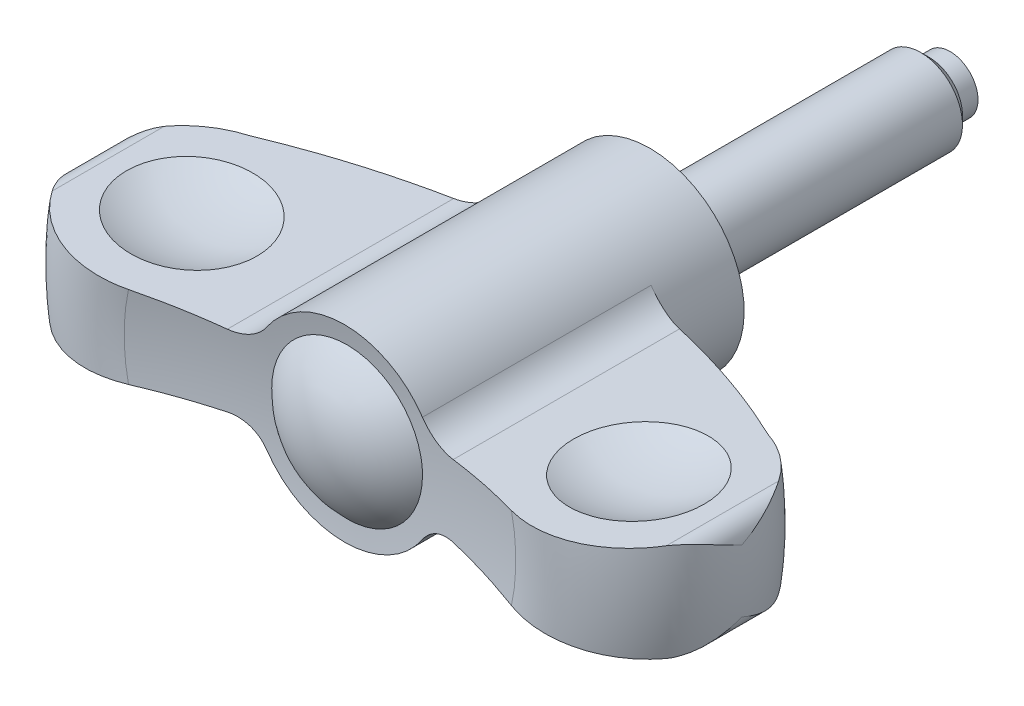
ISO-10303-21;
HEADER;
FILE_DESCRIPTION(('STEP AP214'),'2;1');
FILE_NAME('part.step','',(''),(''),'','','');
FILE_SCHEMA(('AUTOMOTIVE_DESIGN { 1 0 10303 214 1 1 1 1 }'));
ENDSEC;
DATA;
#1=APPLICATION_CONTEXT('core data for automotive mechanical design processes');
#2=APPLICATION_PROTOCOL_DEFINITION('international standard','automotive_design',2000,#1);
#3=PRODUCT_CONTEXT('',#1,'mechanical');
#4=PRODUCT('Part','Part','',(#3));
#5=PRODUCT_RELATED_PRODUCT_CATEGORY('part','',(#4));
#6=PRODUCT_DEFINITION_FORMATION('','',#4);
#7=PRODUCT_DEFINITION_CONTEXT('part definition',#1,'design');
#8=PRODUCT_DEFINITION('design','',#6,#7);
#9=PRODUCT_DEFINITION_SHAPE('','',#8);
#10=(LENGTH_UNIT() NAMED_UNIT(*) SI_UNIT(.MILLI.,.METRE.));
#11=(NAMED_UNIT(*) PLANE_ANGLE_UNIT() SI_UNIT($,.RADIAN.));
#12=(NAMED_UNIT(*) SI_UNIT($,.STERADIAN.) SOLID_ANGLE_UNIT());
#13=UNCERTAINTY_MEASURE_WITH_UNIT(LENGTH_MEASURE(1.E-05),#10,'distance_accuracy_value','');
#14=(GEOMETRIC_REPRESENTATION_CONTEXT(3) GLOBAL_UNCERTAINTY_ASSIGNED_CONTEXT((#13)) GLOBAL_UNIT_ASSIGNED_CONTEXT((#10,
#11,#12)) REPRESENTATION_CONTEXT('',''));
#15=CARTESIAN_POINT('',(0.,0.,0.));
#16=DIRECTION('',(0.,0.,1.));
#17=DIRECTION('',(1.,0.,0.));
#18=AXIS2_PLACEMENT_3D('',#15,#16,#17);
#19=CARTESIAN_POINT('',(0.,0.,60.8916836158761));
#20=DIRECTION('',(0.,0.,-1.));
#21=DIRECTION('',(0.,1.,0.));
#22=AXIS2_PLACEMENT_3D('',#19,#20,#21);
#23=DEGENERATE_TOROIDAL_SURFACE('',#22,7.24809636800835,57.133049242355,.F.);
#24=CARTESIAN_POINT('',(8.0882150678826,2.57020553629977,5.96810530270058));
#25=CARTESIAN_POINT('',(8.00997344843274,2.56497338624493,5.94629000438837));
#26=CARTESIAN_POINT('',(7.93143946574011,2.5630200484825,5.92486614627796));
#27=CARTESIAN_POINT('',(7.77422277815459,2.56573749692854,5.88295181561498));
#28=CARTESIAN_POINT('',(7.69554004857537,2.57040950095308,5.86246151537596));
#29=CARTESIAN_POINT('',(7.45993217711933,2.59446790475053,5.80261995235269));
#30=CARTESIAN_POINT('',(7.30348188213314,2.62389903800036,5.76490768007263));
#31=CARTESIAN_POINT('',(6.99637317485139,2.70941155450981,5.69535012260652));
#32=CARTESIAN_POINT('',(6.84572761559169,2.7655487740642,5.66351732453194));
#33=CARTESIAN_POINT('',(6.55526150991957,2.90348395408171,5.60733410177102));
#34=CARTESIAN_POINT('',(6.41542505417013,2.98524327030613,5.5829725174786));
#35=CARTESIAN_POINT('',(6.21564820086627,3.12665619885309,5.55280138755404));
#36=CARTESIAN_POINT('',(6.14994832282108,3.17769981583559,5.54373343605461));
#37=CARTESIAN_POINT('',(6.02316286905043,3.28560819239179,5.52805647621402));
#38=CARTESIAN_POINT('',(5.9620773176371,3.34247298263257,5.52144748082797));
#39=CARTESIAN_POINT('',(5.84481263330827,3.46187538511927,5.51078652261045));
#40=CARTESIAN_POINT('',(5.78866161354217,3.52444182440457,5.5067484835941));
#41=CARTESIAN_POINT('',(5.6821370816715,3.65444758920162,5.50134928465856));
#42=CARTESIAN_POINT('',(5.63176510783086,3.721888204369,5.4999888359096));
#43=CARTESIAN_POINT('',(5.58454817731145,3.79148016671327,5.50000000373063));
#44=B_SPLINE_CURVE_WITH_KNOTS('',3,(#24,#25,#26,#27,#28,#29,#30,#31,#32,#33,#34,#35,#36,#37,#38,
#39,#40,#41,#42,#43),.UNSPECIFIED.,.F.,.F.,(4,2,2,2,2,2,2,2,2,4),(0.,0.244043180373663,
0.488131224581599,0.976413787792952,1.46572175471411,1.95429525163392,2.20506346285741,
2.45583299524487,2.70794934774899,2.96013265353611),.UNSPECIFIED.);
#45=CARTESIAN_POINT('',(8.0880150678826,2.5701921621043,5.96804953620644));
#46=VERTEX_POINT('',#45);
#47=CARTESIAN_POINT('',(5.5846839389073,3.791280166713,5.5));
#48=VERTEX_POINT('',#47);
#49=EDGE_CURVE('E156',#46,#48,#44,.T.);
#50=ORIENTED_EDGE('',*,*,#49,.F.);
#51=CARTESIAN_POINT('',(18.5568278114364,3.26987550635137,10.063986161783));
#52=CARTESIAN_POINT('',(17.7202118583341,3.21396025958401,9.63606709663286));
#53=CARTESIAN_POINT('',(16.8730027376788,3.15733701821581,9.2289826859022));
#54=CARTESIAN_POINT('',(15.1615683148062,3.04295325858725,8.45851890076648));
#55=CARTESIAN_POINT('',(14.2973907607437,2.98519593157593,8.09503297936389));
#56=CARTESIAN_POINT('',(12.5519653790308,2.86854038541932,7.41164455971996));
#57=CARTESIAN_POINT('',(11.6707170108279,2.80964213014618,7.09174344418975));
#58=CARTESIAN_POINT('',(10.3366076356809,2.72047689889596,6.64515483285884));
#59=CARTESIAN_POINT('',(9.88928279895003,2.6905799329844,6.50167304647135));
#60=CARTESIAN_POINT('',(8.99112522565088,2.63055155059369,6.22618011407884));
#61=CARTESIAN_POINT('',(8.54029244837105,2.60042013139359,6.09416910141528));
#62=CARTESIAN_POINT('',(8.08781506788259,2.57017879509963,5.96799377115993));
#63=B_SPLINE_CURVE_WITH_KNOTS('',3,(#51,#52,#53,#54,#55,#56,#57,#58,#59,#60,#61,#62),
.UNSPECIFIED.,.F.,.F.,(4,2,2,2,2,4),(0.,2.82377208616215,5.64049635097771,8.4573099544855,
9.86934742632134,11.281401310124),.UNSPECIFIED.);
#64=CARTESIAN_POINT('',(18.55643678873,3.26984937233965,10.063786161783));
#65=VERTEX_POINT('',#64);
#66=EDGE_CURVE('E201',#65,#46,#63,.T.);
#67=ORIENTED_EDGE('',*,*,#66,.F.);
#68=CARTESIAN_POINT('',(0.,0.,10.063786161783));
#69=DIRECTION('',(0.,0.,-1.));
#70=DIRECTION('',(0.,1.,0.));
#71=AXIS2_PLACEMENT_3D('',#68,#69,#70);
#72=CIRCLE('',#71,18.84232632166);
#73=CARTESIAN_POINT('',(18.55643678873,-3.26984937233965,10.063786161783));
#74=VERTEX_POINT('',#73);
#75=EDGE_CURVE('E469',#65,#74,#72,.T.);
#76=ORIENTED_EDGE('',*,*,#75,.T.);
#77=CARTESIAN_POINT('',(8.0878150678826,-2.57017879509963,5.96799377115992));
#78=CARTESIAN_POINT('',(8.43648524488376,-2.59348217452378,6.06521586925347));
#79=CARTESIAN_POINT('',(8.78418982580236,-2.61672101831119,6.16591362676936));
#80=CARTESIAN_POINT('',(9.47752423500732,-2.66306003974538,6.37414417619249));
#81=CARTESIAN_POINT('',(9.82315423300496,-2.68616022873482,6.48167640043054));
#82=CARTESIAN_POINT('',(10.8568675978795,-2.7552484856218,6.81439605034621));
#83=CARTESIAN_POINT('',(11.5417095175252,-2.80101991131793,7.04968835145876));
#84=CARTESIAN_POINT('',(13.5766416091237,-2.93702464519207,7.79319141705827));
#85=CARTESIAN_POINT('',(14.9128146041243,-3.02632779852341,8.34061833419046));
#86=CARTESIAN_POINT('',(16.618242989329,-3.14031014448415,9.11672807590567));
#87=CARTESIAN_POINT('',(17.0086949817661,-3.1664060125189,9.29983650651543));
#88=CARTESIAN_POINT('',(17.7857749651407,-3.21834217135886,9.67514693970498));
#89=CARTESIAN_POINT('',(18.1723980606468,-3.2441821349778,9.86735912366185));
#90=CARTESIAN_POINT('',(18.5568278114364,-3.26987550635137,10.063986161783));
#91=B_SPLINE_CURVE_WITH_KNOTS('',3,(#77,#78,#79,#80,#81,#82,#83,#84,#85,#86,#87,#88,#89,#90),
.UNSPECIFIED.,.F.,.F.,(4,2,2,2,2,2,4),(0.,1.0881425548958,2.17619484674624,4.35250158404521,
8.68743833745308,9.98350841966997,11.2810638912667),.UNSPECIFIED.);
#92=CARTESIAN_POINT('',(8.0880150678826,-2.5701921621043,5.96804953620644));
#93=VERTEX_POINT('',#92);
#94=EDGE_CURVE('E262',#93,#74,#91,.T.);
#95=ORIENTED_EDGE('',*,*,#94,.F.);
#96=CARTESIAN_POINT('',(5.58454817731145,-3.79148016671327,5.50000000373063));
#97=CARTESIAN_POINT('',(5.62703500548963,-3.72886637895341,5.49999203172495));
#98=CARTESIAN_POINT('',(5.67207292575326,-3.66799067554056,5.50109190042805));
#99=CARTESIAN_POINT('',(5.7668723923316,-3.55013742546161,5.50546469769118));
#100=CARTESIAN_POINT('',(5.81663303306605,-3.49315913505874,5.50873721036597));
#101=CARTESIAN_POINT('',(5.92037232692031,-3.38365000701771,5.51740071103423));
#102=CARTESIAN_POINT('',(5.97433893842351,-3.33110730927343,5.52278581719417));
#103=CARTESIAN_POINT('',(6.0861731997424,-3.23065312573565,5.53558959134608));
#104=CARTESIAN_POINT('',(6.14404090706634,-3.1827417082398,5.54300828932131));
#105=CARTESIAN_POINT('',(6.32281948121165,-3.04645743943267,5.56816484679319));
#106=CARTESIAN_POINT('',(6.44903201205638,-2.96540189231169,5.58881397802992));
#107=CARTESIAN_POINT('',(6.71175482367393,-2.82481579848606,5.63683026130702));
#108=CARTESIAN_POINT('',(6.84827321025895,-2.76530241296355,5.66420274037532));
#109=CARTESIAN_POINT('',(7.13180529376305,-2.66747892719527,5.72532830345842));
#110=CARTESIAN_POINT('',(7.27900617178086,-2.62981214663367,5.75923917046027));
#111=CARTESIAN_POINT('',(7.576319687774,-2.57880440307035,5.83159976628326));
#112=CARTESIAN_POINT('',(7.72642802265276,-2.56542990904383,5.87004316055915));
#113=CARTESIAN_POINT('',(7.91146899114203,-2.56375196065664,5.91959867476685));
#114=CARTESIAN_POINT('',(7.94691227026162,-2.56410633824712,5.92918950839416));
#115=CARTESIAN_POINT('',(8.01766035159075,-2.56615563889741,5.94852854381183));
#116=CARTESIAN_POINT('',(8.05296528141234,-2.56784856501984,5.95827649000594));
#117=CARTESIAN_POINT('',(8.0882150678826,-2.57020553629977,5.96810530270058));
#118=B_SPLINE_CURVE_WITH_KNOTS('',3,(#96,#97,#98,#99,#100,#101,#102,#103,#104,#105,#106,#107,
#108,#109,#110,#111,#112,#113,#114,#115,#116,#117),.UNSPECIFIED.,.F.,.F.,(4,2,2,2,2,2,2,2,2,2,
4),(0.,0.226923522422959,0.453803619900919,0.680056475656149,0.906312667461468,1.35828167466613,
1.81060994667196,2.27565813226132,2.74006391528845,2.85020967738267,2.96019142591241),.UNSPECIFIED.);
#119=CARTESIAN_POINT('',(5.5846839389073,-3.791280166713,5.5));
#120=VERTEX_POINT('',#119);
#121=EDGE_CURVE('E254',#120,#93,#118,.T.);
#122=ORIENTED_EDGE('',*,*,#121,.F.);
#123=CARTESIAN_POINT('',(0.,0.,5.5));
#124=DIRECTION('',(0.,0.,-1.));
#125=DIRECTION('',(0.,1.,0.));
#126=AXIS2_PLACEMENT_3D('',#123,#124,#125);
#127=CIRCLE('',#126,6.75);
#128=EDGE_CURVE('E462',#48,#120,#127,.T.);
#129=ORIENTED_EDGE('',*,*,#128,.F.);
#130=EDGE_LOOP('',(#50,#67,#76,#95,#122,#129));
#131=FACE_BOUND('',#130,.T.);
#132=ADVANCED_FACE('F14',(#131),#23,.F.);
#133=CARTESIAN_POINT('',(0.,0.,16.8000000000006));
#134=DIRECTION('',(0.,0.,-1.));
#135=DIRECTION('',(0.,1.,0.));
#136=AXIS2_PLACEMENT_3D('',#133,#134,#135);
#137=TOROIDAL_SURFACE('',#136,16.3000000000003,7.19999999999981);
#138=CARTESIAN_POINT('',(13.443007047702,2.92809317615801,10.063586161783));
#139=CARTESIAN_POINT('',(13.2500457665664,2.9151966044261,10.1357408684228));
#140=CARTESIAN_POINT('',(13.0601324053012,2.90250374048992,10.2160710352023));
#141=CARTESIAN_POINT('',(12.6877100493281,2.87761288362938,10.3924240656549));
#142=CARTESIAN_POINT('',(12.5052008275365,2.86541487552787,10.4884464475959));
#143=CARTESIAN_POINT('',(12.1489194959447,2.84160280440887,10.6955091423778));
#144=CARTESIAN_POINT('',(11.975145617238,2.82998862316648,10.8065463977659));
#145=CARTESIAN_POINT('',(11.637533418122,2.80742430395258,11.0428740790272));
#146=CARTESIAN_POINT('',(11.4736949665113,2.79647415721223,11.168164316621));
#147=CARTESIAN_POINT('',(11.1570734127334,2.7753127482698,11.4321870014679));
#148=CARTESIAN_POINT('',(11.0042945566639,2.76510176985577,11.5709245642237));
#149=CARTESIAN_POINT('',(10.7109328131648,2.74549493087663,11.8608983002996));
#150=CARTESIAN_POINT('',(10.5703542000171,2.73609935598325,12.0121388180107));
#151=CARTESIAN_POINT('',(10.3025713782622,2.71820208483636,12.3259661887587));
#152=CARTESIAN_POINT('',(10.1753613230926,2.70969999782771,12.4885480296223));
#153=CARTESIAN_POINT('',(9.93523518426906,2.69365116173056,12.823988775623));
#154=CARTESIAN_POINT('',(9.82231883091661,2.68610439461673,12.996847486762));
#155=CARTESIAN_POINT('',(9.6124094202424,2.67207509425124,13.3504168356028));
#156=CARTESIAN_POINT('',(9.515312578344,2.66558562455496,13.5310655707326));
#157=CARTESIAN_POINT('',(9.33694719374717,2.65366456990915,13.8999735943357));
#158=CARTESIAN_POINT('',(9.25567307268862,2.64823261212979,14.088230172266));
#159=CARTESIAN_POINT('',(9.1095973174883,2.63846963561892,14.4711021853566));
#160=CARTESIAN_POINT('',(9.0447989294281,2.63413883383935,14.6657188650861));
#161=CARTESIAN_POINT('',(8.93227844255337,2.62661852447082,15.0598492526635));
#162=CARTESIAN_POINT('',(8.88455601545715,2.62342899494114,15.25936286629));
#163=CARTESIAN_POINT('',(8.80746852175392,2.61827685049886,15.6574650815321));
#164=CARTESIAN_POINT('',(8.77773054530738,2.61628931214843,15.8559812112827));
#165=CARTESIAN_POINT('',(8.73529826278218,2.61345334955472,16.2548338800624));
#166=CARTESIAN_POINT('',(8.72260367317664,2.61260490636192,16.4551703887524));
#167=CARTESIAN_POINT('',(8.71437606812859,2.61205501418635,16.8561671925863));
#168=CARTESIAN_POINT('',(8.71884052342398,2.6123533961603,17.0568274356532));
#169=CARTESIAN_POINT('',(8.74488386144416,2.6140940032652,17.4570282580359));
#170=CARTESIAN_POINT('',(8.76646264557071,2.61553622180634,17.6565688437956));
#171=CARTESIAN_POINT('',(8.82608238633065,2.61952090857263,18.0500864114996));
#172=CARTESIAN_POINT('',(8.8638706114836,2.62204648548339,18.244101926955));
#173=CARTESIAN_POINT('',(8.95554073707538,2.62817326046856,18.6283441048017));
#174=CARTESIAN_POINT('',(9.00942811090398,2.6317748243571,18.818569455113));
#175=CARTESIAN_POINT('',(9.13281555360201,2.64002142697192,19.1937999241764));
#176=CARTESIAN_POINT('',(9.20231107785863,2.64466616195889,19.3788065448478));
#177=CARTESIAN_POINT('',(9.35638258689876,2.65496353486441,19.7424794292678));
#178=CARTESIAN_POINT('',(9.4409642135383,2.66061654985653,19.921143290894));
#179=CARTESIAN_POINT('',(9.62545322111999,2.67294687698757,20.2726485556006));
#180=CARTESIAN_POINT('',(9.7255069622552,2.6796339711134,20.4454127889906));
#181=CARTESIAN_POINT('',(9.93957002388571,2.69394088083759,20.7821124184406));
#182=CARTESIAN_POINT('',(10.0535844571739,2.70156103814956,20.9460445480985));
#183=CARTESIAN_POINT('',(10.2946584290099,2.71767322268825,21.2638986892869));
#184=CARTESIAN_POINT('',(10.4217143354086,2.7261650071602,21.4178234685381));
#185=CARTESIAN_POINT('',(10.688029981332,2.74396421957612,21.714770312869));
#186=CARTESIAN_POINT('',(10.8272940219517,2.75327193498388,21.8577885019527));
#187=CARTESIAN_POINT('',(11.1201972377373,2.77284812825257,22.1349543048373));
#188=CARTESIAN_POINT('',(11.2740848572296,2.78313321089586,22.2688382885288));
#189=CARTESIAN_POINT('',(11.5924511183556,2.80441122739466,22.5232972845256));
#190=CARTESIAN_POINT('',(11.7569299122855,2.81540417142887,22.6438721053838));
#191=CARTESIAN_POINT('',(12.0953583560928,2.83802304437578,22.8709220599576));
#192=CARTESIAN_POINT('',(12.2693100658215,2.84964911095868,22.9773941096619));
#193=CARTESIAN_POINT('',(12.6253835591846,2.87344729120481,23.1754492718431));
#194=CARTESIAN_POINT('',(12.8075027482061,2.88561923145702,23.267037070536));
#195=CARTESIAN_POINT('',(13.1810420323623,2.91058473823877,23.4357878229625));
#196=CARTESIAN_POINT('',(13.3725503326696,2.92338419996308,23.5127547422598));
#197=CARTESIAN_POINT('',(13.7613485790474,2.94936953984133,23.6502587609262));
#198=CARTESIAN_POINT('',(13.958638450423,2.96255541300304,23.7107960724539));
#199=CARTESIAN_POINT('',(14.3576152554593,2.98922103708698,23.8149976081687));
#200=CARTESIAN_POINT('',(14.5593023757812,3.00270080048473,23.8586611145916));
#201=CARTESIAN_POINT('',(14.9656299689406,3.02985771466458,23.9287762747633));
#202=CARTESIAN_POINT('',(15.1702703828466,3.04353486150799,23.9552282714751));
#203=CARTESIAN_POINT('',(15.5810553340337,3.07098968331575,23.9907056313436));
#204=CARTESIAN_POINT('',(15.7871999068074,3.08476736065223,23.9997305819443));
#205=CARTESIAN_POINT('',(16.1994347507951,3.11231908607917,24.0002574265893));
#206=CARTESIAN_POINT('',(16.4055250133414,3.12609313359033,23.9917658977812));
#207=CARTESIAN_POINT('',(16.8162992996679,3.15354724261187,23.9572980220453));
#208=CARTESIAN_POINT('',(17.020982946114,3.16722727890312,23.9313171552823));
#209=CARTESIAN_POINT('',(17.4273317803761,3.19438561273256,23.8620348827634));
#210=CARTESIAN_POINT('',(17.6289980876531,3.20786398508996,23.8187400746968));
#211=CARTESIAN_POINT('',(18.0267250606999,3.23444607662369,23.7154246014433));
#212=CARTESIAN_POINT('',(18.2228121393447,3.24755156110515,23.6555060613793));
#213=CARTESIAN_POINT('',(18.6091495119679,3.27337242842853,23.5192613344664));
#214=CARTESIAN_POINT('',(18.7994018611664,3.28608794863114,23.4429410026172));
#215=CARTESIAN_POINT('',(19.1728922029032,3.31105018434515,23.2743446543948));
#216=CARTESIAN_POINT('',(19.3561252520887,3.32329656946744,23.182057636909));
#217=CARTESIAN_POINT('',(19.7140940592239,3.34722142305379,22.9822113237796));
#218=CARTESIAN_POINT('',(19.8888301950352,3.35889991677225,22.8746527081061));
#219=CARTESIAN_POINT('',(20.2275235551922,3.38153649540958,22.6457025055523));
#220=CARTESIAN_POINT('',(20.3915386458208,3.39249844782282,22.5243968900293));
#221=CARTESIAN_POINT('',(20.7087215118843,3.41369737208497,22.268296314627));
#222=CARTESIAN_POINT('',(20.8618896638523,3.42393436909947,22.1335018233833));
#223=CARTESIAN_POINT('',(21.1559703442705,3.44358925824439,21.8516648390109));
#224=CARTESIAN_POINT('',(21.2969064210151,3.45300872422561,21.7046469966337));
#225=CARTESIAN_POINT('',(21.5657772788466,3.47097871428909,21.3992346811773));
#226=CARTESIAN_POINT('',(21.6937203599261,3.47952979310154,21.2408475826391));
#227=CARTESIAN_POINT('',(21.8466005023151,3.48974754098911,21.034256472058));
#228=CARTESIAN_POINT('',(21.8780226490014,3.49184764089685,20.9907857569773));
#229=CARTESIAN_POINT('',(21.9398601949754,3.49598055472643,20.903190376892));
#230=CARTESIAN_POINT('',(21.9702764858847,3.49801342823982,20.8590663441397));
#231=CARTESIAN_POINT('',(22.0002,3.50001336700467,20.8146029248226));
#232=B_SPLINE_CURVE_WITH_KNOTS('',3,(#138,#139,#140,#141,#142,#143,#144,#145,#146,#147,#148,
#149,#150,#151,#152,#153,#154,#155,#156,#157,#158,#159,#160,#161,#162,#163,#164,#165,#166,#167,
#168,#169,#170,#171,#172,#173,#174,#175,#176,#177,#178,#179,#180,#181,#182,#183,#184,#185,#186,
#187,#188,#189,#190,#191,#192,#193,#194,#195,#196,#197,#198,#199,#200,#201,#202,#203,#204,#205,
#206,#207,#208,#209,#210,#211,#212,#213,#214,#215,#216,#217,#218,#219,#220,#221,#222,#223,#224,
#225,#226,#227,#228,#229,#230,#231),.UNSPECIFIED.,.F.,.F.,(4,2,2,2,2,2,2,2,2,2,2,2,2,2,2,2,2,2,
2,2,2,2,2,2,2,2,2,2,2,2,2,2,2,2,2,2,2,2,2,2,2,2,2,2,2,2,4),(0.,0.61905342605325,
1.23808785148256,1.85699641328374,2.47589680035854,3.09503355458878,3.71438635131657,
4.3334671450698,4.95253625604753,5.56736438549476,6.18197536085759,6.79670733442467,
7.41142748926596,8.01292036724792,8.61440323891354,9.21579745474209,9.81718820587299,
10.4095249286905,11.0020632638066,11.5944292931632,12.1870173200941,12.7855991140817,
13.3844007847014,13.9830361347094,14.5818832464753,15.1938756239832,15.8058768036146,
16.4180115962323,17.0299532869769,17.6495959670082,18.2692306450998,18.8888916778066,
19.5085403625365,20.1282037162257,20.7476344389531,21.3672253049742,21.9865802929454,
22.6022115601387,23.217623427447,23.8334610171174,24.4492711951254,25.061423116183,
25.6735537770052,26.2844785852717,26.8950106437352,27.0560402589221,27.2169230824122),.UNSPECIFIED.);
#233=CARTESIAN_POINT('',(13.7144513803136,2.94623516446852,23.631914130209));
#234=VERTEX_POINT('',#233);
#235=CARTESIAN_POINT('',(22.,3.5,20.8149000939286));
#236=VERTEX_POINT('',#235);
#237=EDGE_CURVE('E270',#234,#236,#232,.T.);
#238=ORIENTED_EDGE('',*,*,#237,.F.);
#239=CARTESIAN_POINT('',(0.,0.,23.631914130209));
#240=DIRECTION('',(0.,0.,-1.));
#241=DIRECTION('',(0.,1.,0.));
#242=AXIS2_PLACEMENT_3D('',#239,#240,#241);
#243=CIRCLE('',#242,14.027347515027);
#244=CARTESIAN_POINT('',(13.7144513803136,-2.94623516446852,23.631914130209));
#245=VERTEX_POINT('',#244);
#246=EDGE_CURVE('E207',#234,#245,#243,.T.);
#247=ORIENTED_EDGE('',*,*,#246,.T.);
#248=CARTESIAN_POINT('',(22.0002,-3.50001336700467,20.8146029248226));
#249=CARTESIAN_POINT('',(21.8869659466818,-3.49244536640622,20.9829001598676));
#250=CARTESIAN_POINT('',(21.7665908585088,-3.48440009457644,21.146364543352));
#251=CARTESIAN_POINT('',(21.5125154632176,-3.46741895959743,21.4625195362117));
#252=CARTESIAN_POINT('',(21.3788160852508,-3.45848315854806,21.6152108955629));
#253=CARTESIAN_POINT('',(21.0991608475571,-3.43979239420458,21.9086013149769));
#254=CARTESIAN_POINT('',(20.9532163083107,-3.43003818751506,22.0493112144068));
#255=CARTESIAN_POINT('',(20.6500231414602,-3.40977426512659,22.3179109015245));
#256=CARTESIAN_POINT('',(20.492774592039,-3.399264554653,22.4458007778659));
#257=CARTESIAN_POINT('',(20.1680719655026,-3.377563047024,22.6878898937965));
#258=CARTESIAN_POINT('',(20.0006161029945,-3.36637113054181,22.8020867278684));
#259=CARTESIAN_POINT('',(19.6566594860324,-3.34338278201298,23.0160136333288));
#260=CARTESIAN_POINT('',(19.4801554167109,-3.33158612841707,23.115738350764));
#261=CARTESIAN_POINT('',(19.1195107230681,-3.30748243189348,23.2999405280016));
#262=CARTESIAN_POINT('',(18.9353740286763,-3.29517565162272,23.384425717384));
#263=CARTESIAN_POINT('',(18.5606181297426,-3.27012883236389,23.5376689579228));
#264=CARTESIAN_POINT('',(18.3699965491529,-3.25738863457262,23.6064211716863));
#265=CARTESIAN_POINT('',(17.9830362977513,-3.23152613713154,23.7279050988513));
#266=CARTESIAN_POINT('',(17.7866806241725,-3.2184027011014,23.7805824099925));
#267=CARTESIAN_POINT('',(17.3901835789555,-3.19190281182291,23.869278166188));
#268=CARTESIAN_POINT('',(17.1900408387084,-3.17852626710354,23.905290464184));
#269=CARTESIAN_POINT('',(16.7874574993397,-3.15161960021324,23.9604036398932));
#270=CARTESIAN_POINT('',(16.5850169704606,-3.13808948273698,23.9795050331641));
#271=CARTESIAN_POINT('',(16.1792478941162,-3.11096989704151,24.0006952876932));
#272=CARTESIAN_POINT('',(15.9759193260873,-3.09738042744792,24.0027837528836));
#273=CARTESIAN_POINT('',(15.5684666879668,-3.07014832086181,23.9899203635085));
#274=CARTESIAN_POINT('',(15.364346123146,-3.05650591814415,23.9748568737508));
#275=CARTESIAN_POINT('',(14.9580777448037,-3.02935296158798,23.927642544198));
#276=CARTESIAN_POINT('',(14.755929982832,-3.01584241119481,23.8954912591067));
#277=CARTESIAN_POINT('',(14.3550670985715,-2.98905073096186,23.8143605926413));
#278=CARTESIAN_POINT('',(14.1563513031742,-2.97576955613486,23.7653845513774));
#279=CARTESIAN_POINT('',(13.7636331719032,-2.94952223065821,23.6509482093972));
#280=CARTESIAN_POINT('',(13.5696323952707,-2.93655618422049,23.5854825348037));
#281=CARTESIAN_POINT('',(13.1865164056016,-2.91095061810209,23.4380671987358));
#282=CARTESIAN_POINT('',(12.9974412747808,-2.89831377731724,23.3560128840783));
#283=CARTESIAN_POINT('',(12.6268363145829,-2.87354438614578,23.1762764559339));
#284=CARTESIAN_POINT('',(12.4453065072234,-2.86141183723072,23.0785942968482));
#285=CARTESIAN_POINT('',(12.0910342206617,-2.83773404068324,22.8682633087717));
#286=CARTESIAN_POINT('',(11.918293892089,-2.8261889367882,22.7556108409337));
#287=CARTESIAN_POINT('',(11.5829402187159,-2.80377556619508,22.5161828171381));
#288=CARTESIAN_POINT('',(11.420323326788,-2.79290706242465,22.3894122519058));
#289=CARTESIAN_POINT('',(11.1059013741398,-2.77189266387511,22.1222291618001));
#290=CARTESIAN_POINT('',(10.954126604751,-2.76174879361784,21.9817808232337));
#291=CARTESIAN_POINT('',(10.663050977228,-2.74229474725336,21.6885550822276));
#292=CARTESIAN_POINT('',(10.5237454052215,-2.7329842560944,21.5357823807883));
#293=CARTESIAN_POINT('',(10.2585504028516,-2.71525994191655,21.2188580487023));
#294=CARTESIAN_POINT('',(10.1326659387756,-2.7068464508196,21.0547022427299));
#295=CARTESIAN_POINT('',(9.89540453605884,-2.69098907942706,20.716270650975));
#296=CARTESIAN_POINT('',(9.78402188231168,-2.68354481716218,20.5419988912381));
#297=CARTESIAN_POINT('',(9.57753567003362,-2.66974430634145,20.1860989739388));
#298=CARTESIAN_POINT('',(9.48229586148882,-2.66337895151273,20.0045502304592));
#299=CARTESIAN_POINT('',(9.3077215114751,-2.65171127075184,19.6340070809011));
#300=CARTESIAN_POINT('',(9.22838099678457,-2.64640854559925,19.4450155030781));
#301=CARTESIAN_POINT('',(9.08624438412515,-2.63690884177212,19.0608700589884));
#302=CARTESIAN_POINT('',(9.02344908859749,-2.63271191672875,18.865715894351));
#303=CARTESIAN_POINT('',(8.91497467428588,-2.62546202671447,18.4706862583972));
#304=CARTESIAN_POINT('',(8.86929523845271,-2.62240904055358,18.2708108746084));
#305=CARTESIAN_POINT('',(8.79627719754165,-2.61752887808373,17.8722020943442));
#306=CARTESIAN_POINT('',(8.76856256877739,-2.61567657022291,17.6735378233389));
#307=CARTESIAN_POINT('',(8.73017446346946,-2.61311090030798,17.2745631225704));
#308=CARTESIAN_POINT('',(8.71950071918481,-2.61239752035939,17.0742527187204));
#309=CARTESIAN_POINT('',(8.71529310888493,-2.61211630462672,16.6734663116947));
#310=CARTESIAN_POINT('',(8.72175798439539,-2.61254838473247,16.4729903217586));
#311=CARTESIAN_POINT('',(8.75176494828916,-2.61455390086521,16.0733272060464));
#312=CARTESIAN_POINT('',(8.77530694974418,-2.61612733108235,15.8741400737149));
#313=CARTESIAN_POINT('',(8.83878915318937,-2.62037016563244,15.4813635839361));
#314=CARTESIAN_POINT('',(8.87848770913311,-2.62302341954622,15.287734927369));
#315=CARTESIAN_POINT('',(8.97393104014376,-2.62940237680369,14.9044232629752));
#316=CARTESIAN_POINT('',(9.02968125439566,-2.63312844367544,14.7147416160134));
#317=CARTESIAN_POINT('',(9.15673580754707,-2.64162013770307,14.3407362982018));
#318=CARTESIAN_POINT('',(9.22803659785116,-2.64638552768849,14.1564114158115));
#319=CARTESIAN_POINT('',(9.38562068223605,-2.65691766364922,13.7943056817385));
#320=CARTESIAN_POINT('',(9.47190458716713,-2.66268445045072,13.6165250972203));
#321=CARTESIAN_POINT('',(9.65980249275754,-2.67524261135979,13.2667770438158));
#322=CARTESIAN_POINT('',(9.7615742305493,-2.6820445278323,13.0948947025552));
#323=CARTESIAN_POINT('',(9.97895442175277,-2.69657313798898,12.7601587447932));
#324=CARTESIAN_POINT('',(10.0945629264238,-2.70429983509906,12.5973051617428));
#325=CARTESIAN_POINT('',(10.3388280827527,-2.72062530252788,12.2815998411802));
#326=CARTESIAN_POINT('',(10.4674919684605,-2.7292245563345,12.1287537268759));
#327=CARTESIAN_POINT('',(10.7368892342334,-2.74722972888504,11.8341521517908));
#328=CARTESIAN_POINT('',(10.8776225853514,-2.75663564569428,11.6923966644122));
#329=CARTESIAN_POINT('',(11.1735584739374,-2.77641452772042,11.4177499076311));
#330=CARTESIAN_POINT('',(11.3290201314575,-2.78680481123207,11.2851390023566));
#331=CARTESIAN_POINT('',(11.6503816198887,-2.80828301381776,11.0334204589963));
#332=CARTESIAN_POINT('',(11.8162777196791,-2.81937068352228,10.9143080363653));
#333=CARTESIAN_POINT('',(12.1571151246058,-2.84215055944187,10.6905168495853));
#334=CARTESIAN_POINT('',(12.3320419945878,-2.85384180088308,10.5858159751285));
#335=CARTESIAN_POINT('',(12.6898958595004,-2.8777589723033,10.391386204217));
#336=CARTESIAN_POINT('',(12.8728180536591,-2.88998458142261,10.3016484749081));
#337=CARTESIAN_POINT('',(13.122358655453,-2.90666263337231,10.1918600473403));
#338=CARTESIAN_POINT('',(13.1860214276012,-2.91091753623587,10.1649193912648));
#339=CARTESIAN_POINT('',(13.3140099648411,-2.91947165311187,10.112878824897));
#340=CARTESIAN_POINT('',(13.3783349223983,-2.92377081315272,10.0877769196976));
#341=CARTESIAN_POINT('',(13.443007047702,-2.92809317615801,10.063586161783));
#342=B_SPLINE_CURVE_WITH_KNOTS('',3,(#248,#249,#250,#251,#252,#253,#254,#255,#256,#257,#258,
#259,#260,#261,#262,#263,#264,#265,#266,#267,#268,#269,#270,#271,#272,#273,#274,#275,#276,#277,
#278,#279,#280,#281,#282,#283,#284,#285,#286,#287,#288,#289,#290,#291,#292,#293,#294,#295,#296,
#297,#298,#299,#300,#301,#302,#303,#304,#305,#306,#307,#308,#309,#310,#311,#312,#313,#314,#315,
#316,#317,#318,#319,#320,#321,#322,#323,#324,#325,#326,#327,#328,#329,#330,#331,#332,#333,#334,
#335,#336,#337,#338,#339,#340,#341),.UNSPECIFIED.,.F.,.F.,(4,2,2,2,2,2,2,2,2,2,2,2,2,2,2,2,2,2,
2,2,2,2,2,2,2,2,2,2,2,2,2,2,2,2,2,2,2,2,2,2,2,2,2,2,2,2,4),(0.,0.608767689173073,
1.21749295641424,1.82566153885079,2.43382591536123,3.04209697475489,3.65059249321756,
4.25877850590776,4.86718980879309,5.47763788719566,6.0883109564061,6.69896540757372,
7.30963407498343,7.92430017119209,8.53898228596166,9.15354244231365,9.76830314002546,
10.3870705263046,11.0058397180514,11.6247595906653,12.2434613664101,12.8638290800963,
13.4839612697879,14.1043221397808,14.7244377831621,15.3390262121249,15.9533833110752,
16.5677702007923,17.1821457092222,17.7832066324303,18.3842581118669,18.9852654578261,
19.5862697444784,20.1785973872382,20.77112597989,21.3635195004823,21.9559371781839,
22.5548514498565,23.1537679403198,23.7530181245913,24.3522668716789,24.9653566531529,
25.5782284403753,26.1901492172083,26.8017074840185,27.0094652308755,27.2169941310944),.UNSPECIFIED.);
#343=CARTESIAN_POINT('',(22.,-3.5,20.8149000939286));
#344=VERTEX_POINT('',#343);
#345=EDGE_CURVE('E292',#344,#245,#342,.T.);
#346=ORIENTED_EDGE('',*,*,#345,.F.);
#347=CARTESIAN_POINT('',(23.3936651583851,-2.23303167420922,16.8000000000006));
#348=CARTESIAN_POINT('',(23.3934426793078,-2.23536251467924,16.8051493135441));
#349=CARTESIAN_POINT('',(23.3932143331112,-2.23769289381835,16.8102988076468));
#350=CARTESIAN_POINT('',(23.374314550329,-2.42570445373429,17.2258528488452));
#351=CARTESIAN_POINT('',(23.3183956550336,-2.60830531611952,17.6373544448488));
#352=CARTESIAN_POINT('',(23.1798743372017,-2.85965877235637,18.2505518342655));
#353=CARTESIAN_POINT('',(23.1245479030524,-2.93972311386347,18.4543861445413));
#354=CARTESIAN_POINT('',(22.9956909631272,-3.0890981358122,18.8603432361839));
#355=CARTESIAN_POINT('',(22.922168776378,-3.15841370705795,19.0624667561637));
#356=CARTESIAN_POINT('',(22.7850793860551,-3.2611636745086,19.3959296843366));
#357=CARTESIAN_POINT('',(22.7265638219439,-3.29880232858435,19.5280746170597));
#358=CARTESIAN_POINT('',(22.6018254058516,-3.36602668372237,19.7906656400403));
#359=CARTESIAN_POINT('',(22.5356088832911,-3.39561893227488,19.9211130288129));
#360=CARTESIAN_POINT('',(22.3953169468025,-3.44509635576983,20.1805136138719));
#361=CARTESIAN_POINT('',(22.3212053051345,-3.46493421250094,20.3094566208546));
#362=CARTESIAN_POINT('',(22.2046559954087,-3.4855237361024,20.5007658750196));
#363=CARTESIAN_POINT('',(22.1648550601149,-3.49085996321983,20.5642643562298));
#364=CARTESIAN_POINT('',(22.083565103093,-3.49809816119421,20.6904076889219));
#365=CARTESIAN_POINT('',(22.0420753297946,-3.49999858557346,20.7530521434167));
#366=CARTESIAN_POINT('',(21.9998,-3.49999998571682,20.8151941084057));
#367=B_SPLINE_CURVE_WITH_KNOTS('',3,(#347,#348,#349,#350,#351,#352,#353,#354,#355,#356,#357,
#358,#359,#360,#361,#362,#363,#364,#365,#366),.UNSPECIFIED.,.F.,.F.,(4,2,2,2,2,2,2,2,2,4),(0.,
0.0169705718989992,1.36944581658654,2.04642868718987,2.72310261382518,3.17077232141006,
3.61807665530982,4.06752995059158,4.29283181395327,4.51823506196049),.UNSPECIFIED.);
#368=CARTESIAN_POINT('',(23.393665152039,-2.2330317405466,16.8000000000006));
#369=VERTEX_POINT('',#368);
#370=EDGE_CURVE('E495',#369,#344,#367,.T.);
#371=ORIENTED_EDGE('',*,*,#370,.F.);
#372=CARTESIAN_POINT('',(21.9998,-3.49999998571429,12.7848058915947));
#373=CARTESIAN_POINT('',(22.0666741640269,-3.49996244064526,12.883087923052));
#374=CARTESIAN_POINT('',(22.1315514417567,-3.49523252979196,12.9826100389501));
#375=CARTESIAN_POINT('',(22.2568815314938,-3.47769367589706,13.1835115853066));
#376=CARTESIAN_POINT('',(22.3173409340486,-3.46489705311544,13.2848879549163));
#377=CARTESIAN_POINT('',(22.433364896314,-3.432590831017,13.488746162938));
#378=CARTESIAN_POINT('',(22.4889490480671,-3.41310980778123,13.5912215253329));
#379=CARTESIAN_POINT('',(22.595372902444,-3.36841027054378,13.7974289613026));
#380=CARTESIAN_POINT('',(22.6462099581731,-3.34318858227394,13.9011616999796));
#381=CARTESIAN_POINT('',(22.7740899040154,-3.27011468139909,14.1765334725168));
#382=CARTESIAN_POINT('',(22.8470051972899,-3.21812877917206,14.3490158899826));
#383=CARTESIAN_POINT('',(22.9794561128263,-3.10414337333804,14.6957451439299));
#384=CARTESIAN_POINT('',(23.0389856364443,-3.04213932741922,14.8699927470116));
#385=CARTESIAN_POINT('',(23.197520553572,-2.84462859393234,15.395179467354));
#386=CARTESIAN_POINT('',(23.27632830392,-2.69771476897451,15.7482515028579));
#387=CARTESIAN_POINT('',(23.3443046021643,-2.49442989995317,16.2153989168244));
#388=CARTESIAN_POINT('',(23.3580236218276,-2.44419371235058,16.329236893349));
#389=CARTESIAN_POINT('',(23.3797700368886,-2.34273549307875,16.5569077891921));
#390=CARTESIAN_POINT('',(23.3878040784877,-2.29151468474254,16.6707405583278));
#391=CARTESIAN_POINT('',(23.3932143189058,-2.2376929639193,16.7897010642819));
#392=CARTESIAN_POINT('',(23.3934426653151,-2.23536258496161,16.7948505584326));
#393=CARTESIAN_POINT('',(23.3936651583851,-2.23303167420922,16.8000000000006));
#394=B_SPLINE_CURVE_WITH_KNOTS('',3,(#372,#373,#374,#375,#376,#377,#378,#379,#380,#381,#382,
#383,#384,#385,#386,#387,#388,#389,#390,#391,#392,#393),.UNSPECIFIED.,.F.,.F.,(4,2,2,2,2,2,2,2,
2,2,4),(0.,0.356372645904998,0.712202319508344,1.06652937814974,1.4210528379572,
2.00316709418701,2.58554603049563,3.75135617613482,4.12686584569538,4.50193578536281,
4.51890635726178),.UNSPECIFIED.);
#395=CARTESIAN_POINT('',(22.,-3.5,12.7850999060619));
#396=VERTEX_POINT('',#395);
#397=EDGE_CURVE('E493',#396,#369,#394,.T.);
#398=ORIENTED_EDGE('',*,*,#397,.F.);
#399=CARTESIAN_POINT('',(18.5559048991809,-3.26981382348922,10.063586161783));
#400=CARTESIAN_POINT('',(18.7481532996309,-3.28266274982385,10.1358408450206));
#401=CARTESIAN_POINT('',(18.937321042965,-3.29530578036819,10.2163336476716));
#402=CARTESIAN_POINT('',(19.3081618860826,-3.32009093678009,10.3931469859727));
#403=CARTESIAN_POINT('',(19.4898343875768,-3.33223302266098,10.4894687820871));
#404=CARTESIAN_POINT('',(19.8398224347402,-3.3556244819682,10.6946430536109));
#405=CARTESIAN_POINT('',(20.0083599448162,-3.36688869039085,10.8031155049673));
#406=CARTESIAN_POINT('',(20.3358278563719,-3.38877501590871,11.0337190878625));
#407=CARTESIAN_POINT('',(20.4947599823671,-3.39939724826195,11.1558477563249));
#408=CARTESIAN_POINT('',(20.776421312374,-3.41822208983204,11.3915935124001));
#409=CARTESIAN_POINT('',(20.9007819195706,-3.42653373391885,11.503260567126));
#410=CARTESIAN_POINT('',(21.1414563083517,-3.44261921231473,11.7349898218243));
#411=CARTESIAN_POINT('',(21.2577703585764,-3.45039306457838,11.8550517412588));
#412=CARTESIAN_POINT('',(21.4842055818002,-3.46552686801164,12.1056865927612));
#413=CARTESIAN_POINT('',(21.5941379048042,-3.47287419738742,12.2364309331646));
#414=CARTESIAN_POINT('',(21.8044661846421,-3.48693149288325,12.5054420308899));
#415=CARTESIAN_POINT('',(21.9048606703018,-3.49364136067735,12.6437099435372));
#416=CARTESIAN_POINT('',(22.0002,-3.50001336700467,12.7853970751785));
#417=B_SPLINE_CURVE_WITH_KNOTS('',3,(#399,#400,#401,#402,#403,#404,#405,#406,#407,#408,#409,
#410,#411,#412,#413,#414,#415,#416),.UNSPECIFIED.,.F.,.F.,(4,2,2,2,2,2,2,2,4),(0.,
0.61715812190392,1.23436541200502,1.83590974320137,2.437345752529,2.93898887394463,
3.44061523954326,3.95311321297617,4.46569010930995),.UNSPECIFIED.);
#418=EDGE_CURVE('E271',#74,#396,#417,.T.);
#419=ORIENTED_EDGE('',*,*,#418,.F.);
#420=ORIENTED_EDGE('',*,*,#75,.F.);
#421=CARTESIAN_POINT('',(22.0002,3.50001336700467,12.7853970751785));
#422=CARTESIAN_POINT('',(21.8855721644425,3.4923522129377,12.6150255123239));
#423=CARTESIAN_POINT('',(21.7636224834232,3.48420170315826,12.4496052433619));
#424=CARTESIAN_POINT('',(21.5060663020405,3.46698792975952,12.1298038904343));
#425=CARTESIAN_POINT('',(21.370459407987,3.45792463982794,11.9754231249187));
#426=CARTESIAN_POINT('',(21.0901761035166,3.43919189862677,11.6826017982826));
#427=CARTESIAN_POINT('',(20.9458162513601,3.42954360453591,11.5438566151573));
#428=CARTESIAN_POINT('',(20.6460984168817,3.40951195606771,11.2788991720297));
#429=CARTESIAN_POINT('',(20.4907422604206,3.39912872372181,11.1526848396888));
#430=CARTESIAN_POINT('',(20.1963110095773,3.37945040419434,10.9331636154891));
#431=CARTESIAN_POINT('',(20.0587201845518,3.3702545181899,10.8378487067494));
#432=CARTESIAN_POINT('',(19.7772660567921,3.35144352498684,10.6570247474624));
#433=CARTESIAN_POINT('',(19.633402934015,3.34182842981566,10.5715154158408));
#434=CARTESIAN_POINT('',(19.336920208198,3.32201299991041,10.4089623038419));
#435=CARTESIAN_POINT('',(19.1841783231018,3.31180449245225,10.3321425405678));
#436=CARTESIAN_POINT('',(18.8736362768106,3.2910494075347,10.1895126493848));
#437=CARTESIAN_POINT('',(18.7158354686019,3.28050278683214,10.123703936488));
#438=CARTESIAN_POINT('',(18.5559048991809,3.26981382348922,10.063586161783));
#439=B_SPLINE_CURVE_WITH_KNOTS('',3,(#421,#422,#423,#424,#425,#426,#427,#428,#429,#430,#431,
#432,#433,#434,#435,#436,#437,#438),.UNSPECIFIED.,.F.,.F.,(4,2,2,2,2,2,2,2,4),(0.,
0.616269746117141,1.23255726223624,1.83324114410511,2.43382551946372,2.93633270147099,
3.43882547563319,3.95222437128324,4.46568919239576),.UNSPECIFIED.);
#440=CARTESIAN_POINT('',(22.,3.5,12.7850999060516));
#441=VERTEX_POINT('',#440);
#442=EDGE_CURVE('E490',#441,#65,#439,.T.);
#443=ORIENTED_EDGE('',*,*,#442,.F.);
#444=CARTESIAN_POINT('',(23.3936651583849,2.23303167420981,16.8000000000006));
#445=CARTESIAN_POINT('',(23.3934426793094,2.23536251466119,16.7948506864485));
#446=CARTESIAN_POINT('',(23.3932143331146,2.23769289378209,16.7897011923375));
#447=CARTESIAN_POINT('',(23.3743145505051,2.42570445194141,16.3741471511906));
#448=CARTESIAN_POINT('',(23.3183956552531,2.6083053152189,15.9626455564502));
#449=CARTESIAN_POINT('',(23.1798743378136,2.85965877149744,15.3494481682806));
#450=CARTESIAN_POINT('',(23.1245479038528,2.93972311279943,15.1456138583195));
#451=CARTESIAN_POINT('',(22.995690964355,3.08909813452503,14.7396567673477));
#452=CARTESIAN_POINT('',(22.9221687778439,3.15841370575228,14.537533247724));
#453=CARTESIAN_POINT('',(22.785079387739,3.26116367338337,14.2040703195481));
#454=CARTESIAN_POINT('',(22.7265638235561,3.29880232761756,14.0719253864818));
#455=CARTESIAN_POINT('',(22.6018254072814,3.36602668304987,13.8093343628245));
#456=CARTESIAN_POINT('',(22.5356088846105,3.3956189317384,13.6788869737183));
#457=CARTESIAN_POINT('',(22.3953169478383,3.44509635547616,13.4194863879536));
#458=CARTESIAN_POINT('',(22.3212053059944,3.46493421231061,13.2905433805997));
#459=CARTESIAN_POINT('',(22.2046559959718,3.48552373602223,13.0992341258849));
#460=CARTESIAN_POINT('',(22.1648550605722,3.49085996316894,13.0357356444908));
#461=CARTESIAN_POINT('',(22.0835651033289,3.4980981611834,12.9095923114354));
#462=CARTESIAN_POINT('',(22.0420753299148,3.49999858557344,12.8469478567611));
#463=CARTESIAN_POINT('',(21.9998,3.49999998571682,12.7848058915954));
#464=B_SPLINE_CURVE_WITH_KNOTS('',3,(#444,#445,#446,#447,#448,#449,#450,#451,#452,#453,#454,
#455,#456,#457,#458,#459,#460,#461,#462,#463),.UNSPECIFIED.,.F.,.F.,(4,2,2,2,2,2,2,2,2,4),(0.,
0.0169705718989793,1.36944581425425,2.04642868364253,2.72310260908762,3.17077231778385,
3.61807665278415,4.06752994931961,4.29283181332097,4.5182350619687),.UNSPECIFIED.);
#465=CARTESIAN_POINT('',(23.393665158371,2.23303167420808,16.8000000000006));
#466=VERTEX_POINT('',#465);
#467=EDGE_CURVE('E498',#466,#441,#464,.T.);
#468=ORIENTED_EDGE('',*,*,#467,.F.);
#469=CARTESIAN_POINT('',(21.9998,3.49999998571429,20.8151941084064));
#470=CARTESIAN_POINT('',(22.0666741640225,3.49996244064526,20.7169120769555));
#471=CARTESIAN_POINT('',(22.1315514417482,3.4952325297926,20.617389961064));
#472=CARTESIAN_POINT('',(22.2568815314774,3.47769367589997,20.4164884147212));
#473=CARTESIAN_POINT('',(22.3173409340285,3.46489705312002,20.3151120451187));
#474=CARTESIAN_POINT('',(22.4333648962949,3.43259083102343,20.1112538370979));
#475=CARTESIAN_POINT('',(22.4889490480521,3.41310980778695,20.0087784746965));
#476=CARTESIAN_POINT('',(22.5953729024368,3.36841027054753,19.8025710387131));
#477=CARTESIAN_POINT('',(22.6462099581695,3.34318858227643,19.6988383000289));
#478=CARTESIAN_POINT('',(22.7740899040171,3.27011468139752,19.4234665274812));
#479=CARTESIAN_POINT('',(22.8470051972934,3.21812877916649,19.2509841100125));
#480=CARTESIAN_POINT('',(22.9794561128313,3.1041433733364,18.9042548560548));
#481=CARTESIAN_POINT('',(23.0389856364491,3.04213932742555,18.7300072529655));
#482=CARTESIAN_POINT('',(23.1975205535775,2.84462859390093,18.2048205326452));
#483=CARTESIAN_POINT('',(23.2763283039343,2.69771476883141,17.8517484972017));
#484=CARTESIAN_POINT('',(23.3443046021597,2.49442989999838,17.3846010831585));
#485=CARTESIAN_POINT('',(23.3580236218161,2.44419371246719,17.2707631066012));
#486=CARTESIAN_POINT('',(23.3797700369,2.34273549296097,17.0430922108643));
#487=CARTESIAN_POINT('',(23.3878040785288,2.29151468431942,16.9292594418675));
#488=CARTESIAN_POINT('',(23.3932143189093,2.23769296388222,16.8102989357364));
#489=CARTESIAN_POINT('',(23.3934426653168,2.23536258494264,16.8051494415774));
#490=CARTESIAN_POINT('',(23.3936651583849,2.23303167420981,16.8000000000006));
#491=B_SPLINE_CURVE_WITH_KNOTS('',3,(#469,#470,#471,#472,#473,#474,#475,#476,#477,#478,#479,
#480,#481,#482,#483,#484,#485,#486,#487,#488,#489,#490),.UNSPECIFIED.,.F.,.F.,(4,2,2,2,2,2,2,2,
2,2,4),(0.,0.356372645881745,0.712202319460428,1.06652937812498,1.4210528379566,
2.00316709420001,2.5855460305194,3.75135617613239,4.12686584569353,4.50193578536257,
4.51890635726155),.UNSPECIFIED.);
#492=EDGE_CURVE('E496',#236,#466,#491,.T.);
#493=ORIENTED_EDGE('',*,*,#492,.F.);
#494=EDGE_LOOP('',(#238,#247,#346,#371,#398,#419,#420,#443,#468,#493));
#495=FACE_BOUND('',#494,.T.);
#496=ADVANCED_FACE('F452',(#495),#137,.T.);
#497=CARTESIAN_POINT('',(0.,0.,0.));
#498=DIRECTION('',(0.,0.,-1.));
#499=DIRECTION('',(0.,1.,0.));
#500=AXIS2_PLACEMENT_3D('',#497,#498,#499);
#501=PLANE('',#500);
#502=CARTESIAN_POINT('',(0.,0.,0.));
#503=DIRECTION('',(0.,0.,-1.));
#504=DIRECTION('',(0.,1.,0.));
#505=AXIS2_PLACEMENT_3D('',#502,#503,#504);
#506=CIRCLE('',#505,3.);
#507=CARTESIAN_POINT('',(0.,3.,0.));
#508=VERTEX_POINT('',#507);
#509=EDGE_CURVE('E537',#508,#508,#506,.T.);
#510=ORIENTED_EDGE('',*,*,#509,.F.);
#511=EDGE_LOOP('',(#510));
#512=FACE_BOUND('',#511,.T.);
#513=CARTESIAN_POINT('',(0.,0.,0.));
#514=DIRECTION('',(0.,0.,-1.));
#515=DIRECTION('',(0.,1.,0.));
#516=AXIS2_PLACEMENT_3D('',#513,#514,#515);
#517=CIRCLE('',#516,6.75);
#518=CARTESIAN_POINT('',(0.,6.75,0.));
#519=VERTEX_POINT('',#518);
#520=EDGE_CURVE('E148',#519,#519,#517,.T.);
#521=ORIENTED_EDGE('',*,*,#520,.T.);
#522=EDGE_LOOP('',(#521));
#523=FACE_BOUND('',#522,.T.);
#524=ADVANCED_FACE('F16',(#512,#523),#501,.T.);
#525=CARTESIAN_POINT('',(0.,0.,24.));
#526=DIRECTION('',(0.,0.,-1.));
#527=DIRECTION('',(0.,1.,0.));
#528=AXIS2_PLACEMENT_3D('',#525,#526,#527);
#529=CYLINDRICAL_SURFACE('',#528,6.75);
#530=ORIENTED_EDGE('',*,*,#520,.F.);
#531=EDGE_LOOP('',(#530));
#532=FACE_BOUND('',#531,.T.);
#533=DIRECTION('',(0.,0.,-1.));
#534=VECTOR('',#533,1.);
#535=CARTESIAN_POINT('',(5.5846839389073,3.791280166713,47.));
#536=LINE('',#535,#534);
#537=CARTESIAN_POINT('',(5.5846839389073,3.791280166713,21.8756209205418));
#538=VERTEX_POINT('',#537);
#539=EDGE_CURVE('E142',#538,#48,#536,.T.);
#540=ORIENTED_EDGE('',*,*,#539,.T.);
#541=ORIENTED_EDGE('',*,*,#128,.T.);
#542=DIRECTION('',(0.,0.,-1.));
#543=VECTOR('',#542,1.);
#544=CARTESIAN_POINT('',(5.5846839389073,-3.791280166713,47.));
#545=LINE('',#544,#543);
#546=CARTESIAN_POINT('',(5.5846839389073,-3.791280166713,21.8756209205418));
#547=VERTEX_POINT('',#546);
#548=EDGE_CURVE('E405',#547,#120,#545,.T.);
#549=ORIENTED_EDGE('',*,*,#548,.F.);
#550=CARTESIAN_POINT('',(0.,0.,21.8756209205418));
#551=DIRECTION('',(0.,0.,1.));
#552=DIRECTION('',(0.,-1.,0.));
#553=AXIS2_PLACEMENT_3D('',#550,#551,#552);
#554=CIRCLE('',#553,6.75000000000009);
#555=CARTESIAN_POINT('',(-5.5846839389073,-3.791280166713,21.875620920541));
#556=VERTEX_POINT('',#555);
#557=EDGE_CURVE('E342',#547,#556,#554,.F.);
#558=ORIENTED_EDGE('',*,*,#557,.T.);
#559=DIRECTION('',(0.,0.,-1.));
#560=VECTOR('',#559,1.);
#561=CARTESIAN_POINT('',(-5.5846839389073,-3.791280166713,47.));
#562=LINE('',#561,#560);
#563=CARTESIAN_POINT('',(-5.5846839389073,-3.791280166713,5.5));
#564=VERTEX_POINT('',#563);
#565=EDGE_CURVE('E407',#556,#564,#562,.T.);
#566=ORIENTED_EDGE('',*,*,#565,.T.);
#567=CARTESIAN_POINT('',(-5.5846839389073,3.791280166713,5.5));
#568=VERTEX_POINT('',#567);
#569=EDGE_CURVE('E465',#564,#568,#127,.T.);
#570=ORIENTED_EDGE('',*,*,#569,.T.);
#571=DIRECTION('',(0.,0.,-1.));
#572=VECTOR('',#571,1.);
#573=CARTESIAN_POINT('',(-5.5846839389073,3.791280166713,47.));
#574=LINE('',#573,#572);
#575=CARTESIAN_POINT('',(-5.5846839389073,3.791280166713,21.8756209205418));
#576=VERTEX_POINT('',#575);
#577=EDGE_CURVE('E37',#576,#568,#574,.T.);
#578=ORIENTED_EDGE('',*,*,#577,.F.);
#579=CARTESIAN_POINT('',(0.,0.,21.8756209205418));
#580=DIRECTION('',(0.,0.,1.));
#581=DIRECTION('',(0.,-1.,0.));
#582=AXIS2_PLACEMENT_3D('',#579,#580,#581);
#583=CIRCLE('',#582,6.75000000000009);
#584=EDGE_CURVE('E138',#576,#538,#583,.F.);
#585=ORIENTED_EDGE('',*,*,#584,.T.);
#586=EDGE_LOOP('',(#540,#541,#549,#558,#566,#570,#578,#585));
#587=FACE_BOUND('',#586,.T.);
#588=ADVANCED_FACE('F140',(#532,#587),#529,.T.);
#589=CARTESIAN_POINT('',(-8.0882150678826,-2.57020553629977,5.96810530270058));
#590=CARTESIAN_POINT('',(-8.00997344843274,-2.56497338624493,5.94629000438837));
#591=CARTESIAN_POINT('',(-7.93143946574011,-2.5630200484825,5.92486614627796));
#592=CARTESIAN_POINT('',(-7.77422277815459,-2.56573749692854,5.88295181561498));
#593=CARTESIAN_POINT('',(-7.69554004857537,-2.57040950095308,5.86246151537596));
#594=CARTESIAN_POINT('',(-7.45993217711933,-2.59446790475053,5.80261995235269));
#595=CARTESIAN_POINT('',(-7.30348188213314,-2.62389903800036,5.76490768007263));
#596=CARTESIAN_POINT('',(-6.99637317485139,-2.70941155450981,5.69535012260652));
#597=CARTESIAN_POINT('',(-6.84572761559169,-2.7655487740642,5.66351732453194));
#598=CARTESIAN_POINT('',(-6.55526150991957,-2.90348395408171,5.60733410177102));
#599=CARTESIAN_POINT('',(-6.41542505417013,-2.98524327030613,5.5829725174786));
#600=CARTESIAN_POINT('',(-6.21564820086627,-3.12665619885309,5.55280138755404));
#601=CARTESIAN_POINT('',(-6.14994832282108,-3.17769981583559,5.54373343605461));
#602=CARTESIAN_POINT('',(-6.02316286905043,-3.28560819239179,5.52805647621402));
#603=CARTESIAN_POINT('',(-5.9620773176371,-3.34247298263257,5.52144748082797));
#604=CARTESIAN_POINT('',(-5.84481263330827,-3.46187538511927,5.51078652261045));
#605=CARTESIAN_POINT('',(-5.78866161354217,-3.52444182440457,5.5067484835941));
#606=CARTESIAN_POINT('',(-5.6821370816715,-3.65444758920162,5.50134928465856));
#607=CARTESIAN_POINT('',(-5.63176510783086,-3.721888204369,5.4999888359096));
#608=CARTESIAN_POINT('',(-5.58454817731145,-3.79148016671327,5.50000000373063));
#609=B_SPLINE_CURVE_WITH_KNOTS('',3,(#589,#590,#591,#592,#593,#594,#595,#596,#597,#598,#599,
#600,#601,#602,#603,#604,#605,#606,#607,#608),.UNSPECIFIED.,.F.,.F.,(4,2,2,2,2,2,2,2,2,4),(0.,
0.244043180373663,0.488131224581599,0.976413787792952,1.46572175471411,1.95429525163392,
2.20506346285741,2.45583299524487,2.70794934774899,2.96013265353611),.UNSPECIFIED.);
#610=CARTESIAN_POINT('',(-8.0880150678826,-2.5701921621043,5.96804953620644));
#611=VERTEX_POINT('',#610);
#612=EDGE_CURVE('E246',#611,#564,#609,.T.);
#613=ORIENTED_EDGE('',*,*,#612,.F.);
#614=CARTESIAN_POINT('',(-18.5568278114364,-3.26987550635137,10.063986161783));
#615=CARTESIAN_POINT('',(-17.7202118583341,-3.21396025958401,9.63606709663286));
#616=CARTESIAN_POINT('',(-16.8730027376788,-3.15733701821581,9.2289826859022));
#617=CARTESIAN_POINT('',(-15.1615683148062,-3.04295325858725,8.45851890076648));
#618=CARTESIAN_POINT('',(-14.2973907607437,-2.98519593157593,8.09503297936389));
#619=CARTESIAN_POINT('',(-12.5519653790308,-2.86854038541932,7.41164455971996));
#620=CARTESIAN_POINT('',(-11.6707170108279,-2.80964213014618,7.09174344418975));
#621=CARTESIAN_POINT('',(-10.3366076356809,-2.72047689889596,6.64515483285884));
#622=CARTESIAN_POINT('',(-9.88928279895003,-2.6905799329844,6.50167304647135));
#623=CARTESIAN_POINT('',(-8.99112522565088,-2.63055155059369,6.22618011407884));
#624=CARTESIAN_POINT('',(-8.54029244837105,-2.60042013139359,6.09416910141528));
#625=CARTESIAN_POINT('',(-8.08781506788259,-2.57017879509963,5.96799377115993));
#626=B_SPLINE_CURVE_WITH_KNOTS('',3,(#614,#615,#616,#617,#618,#619,#620,#621,#622,#623,#624,
#625),.UNSPECIFIED.,.F.,.F.,(4,2,2,2,2,4),(0.,2.82377208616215,5.64049635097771,8.4573099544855,
9.86934742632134,11.281401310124),.UNSPECIFIED.);
#627=CARTESIAN_POINT('',(-18.55643678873,-3.26984937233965,10.063786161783));
#628=VERTEX_POINT('',#627);
#629=EDGE_CURVE('E237',#628,#611,#626,.T.);
#630=ORIENTED_EDGE('',*,*,#629,.F.);
#631=CARTESIAN_POINT('',(-18.55643678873,3.26984937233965,10.063786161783));
#632=VERTEX_POINT('',#631);
#633=EDGE_CURVE('E482',#628,#632,#72,.T.);
#634=ORIENTED_EDGE('',*,*,#633,.T.);
#635=CARTESIAN_POINT('',(-8.0878150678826,2.57017879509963,5.96799377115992));
#636=CARTESIAN_POINT('',(-8.43648524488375,2.59348217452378,6.06521586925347));
#637=CARTESIAN_POINT('',(-8.78418982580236,2.61672101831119,6.16591362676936));
#638=CARTESIAN_POINT('',(-9.47752423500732,2.66306003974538,6.37414417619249));
#639=CARTESIAN_POINT('',(-9.82315423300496,2.68616022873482,6.48167640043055));
#640=CARTESIAN_POINT('',(-10.8568675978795,2.7552484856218,6.81439605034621));
#641=CARTESIAN_POINT('',(-11.5417095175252,2.80101991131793,7.04968835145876));
#642=CARTESIAN_POINT('',(-13.5766416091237,2.93702464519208,7.79319141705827));
#643=CARTESIAN_POINT('',(-14.9128146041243,3.02632779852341,8.34061833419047));
#644=CARTESIAN_POINT('',(-16.618242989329,3.14031014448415,9.11672807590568));
#645=CARTESIAN_POINT('',(-17.0086949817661,3.1664060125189,9.29983650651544));
#646=CARTESIAN_POINT('',(-17.7857749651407,3.21834217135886,9.67514693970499));
#647=CARTESIAN_POINT('',(-18.1723980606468,3.2441821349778,9.86735912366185));
#648=CARTESIAN_POINT('',(-18.5568278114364,3.26987550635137,10.063986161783));
#649=B_SPLINE_CURVE_WITH_KNOTS('',3,(#635,#636,#637,#638,#639,#640,#641,#642,#643,#644,#645,
#646,#647,#648),.UNSPECIFIED.,.F.,.F.,(4,2,2,2,2,2,4),(0.,1.08814255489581,2.17619484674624,
4.35250158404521,8.68743833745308,9.98350841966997,11.2810638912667),.UNSPECIFIED.);
#650=CARTESIAN_POINT('',(-8.0880150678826,2.5701921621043,5.96804953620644));
#651=VERTEX_POINT('',#650);
#652=EDGE_CURVE('E228',#651,#632,#649,.T.);
#653=ORIENTED_EDGE('',*,*,#652,.F.);
#654=CARTESIAN_POINT('',(-5.58454817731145,3.79148016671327,5.50000000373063));
#655=CARTESIAN_POINT('',(-5.62703500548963,3.72886637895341,5.49999203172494));
#656=CARTESIAN_POINT('',(-5.67207292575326,3.66799067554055,5.50109190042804));
#657=CARTESIAN_POINT('',(-5.7668723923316,3.55013742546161,5.50546469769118));
#658=CARTESIAN_POINT('',(-5.81663303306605,3.49315913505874,5.50873721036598));
#659=CARTESIAN_POINT('',(-5.92037232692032,3.3836500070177,5.51740071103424));
#660=CARTESIAN_POINT('',(-5.97433893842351,3.33110730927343,5.52278581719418));
#661=CARTESIAN_POINT('',(-6.0861731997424,3.23065312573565,5.53558959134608));
#662=CARTESIAN_POINT('',(-6.14404090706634,3.1827417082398,5.54300828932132));
#663=CARTESIAN_POINT('',(-6.32281948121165,3.04645743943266,5.56816484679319));
#664=CARTESIAN_POINT('',(-6.44903201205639,2.96540189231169,5.58881397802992));
#665=CARTESIAN_POINT('',(-6.71175482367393,2.82481579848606,5.63683026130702));
#666=CARTESIAN_POINT('',(-6.84827321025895,2.76530241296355,5.66420274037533));
#667=CARTESIAN_POINT('',(-7.13180529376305,2.66747892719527,5.72532830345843));
#668=CARTESIAN_POINT('',(-7.27900617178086,2.62981214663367,5.75923917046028));
#669=CARTESIAN_POINT('',(-7.576319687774,2.57880440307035,5.83159976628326));
#670=CARTESIAN_POINT('',(-7.72642802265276,2.56542990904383,5.87004316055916));
#671=CARTESIAN_POINT('',(-7.91146899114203,2.56375196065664,5.91959867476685));
#672=CARTESIAN_POINT('',(-7.94691227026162,2.56410633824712,5.92918950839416));
#673=CARTESIAN_POINT('',(-8.01766035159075,2.56615563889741,5.94852854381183));
#674=CARTESIAN_POINT('',(-8.05296528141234,2.56784856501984,5.95827649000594));
#675=CARTESIAN_POINT('',(-8.0882150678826,2.57020553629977,5.96810530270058));
#676=B_SPLINE_CURVE_WITH_KNOTS('',3,(#654,#655,#656,#657,#658,#659,#660,#661,#662,#663,#664,
#665,#666,#667,#668,#669,#670,#671,#672,#673,#674,#675),.UNSPECIFIED.,.F.,.F.,(4,2,2,2,2,2,2,2,
2,2,4),(0.,0.226923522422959,0.453803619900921,0.680056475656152,0.90631266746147,
1.35828167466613,1.81060994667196,2.27565813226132,2.74006391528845,2.85020967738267,
2.96019142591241),.UNSPECIFIED.);
#677=EDGE_CURVE('E218',#568,#651,#676,.T.);
#678=ORIENTED_EDGE('',*,*,#677,.F.);
#679=ORIENTED_EDGE('',*,*,#569,.F.);
#680=EDGE_LOOP('',(#613,#630,#634,#653,#678,#679));
#681=FACE_BOUND('',#680,.T.);
#682=ADVANCED_FACE('F209',(#681),#23,.F.);
#683=CARTESIAN_POINT('',(-13.4430070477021,-2.92809317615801,10.063586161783));
#684=CARTESIAN_POINT('',(-13.2500457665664,-2.9151966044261,10.1357408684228));
#685=CARTESIAN_POINT('',(-13.0601324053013,-2.90250374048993,10.2160710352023));
#686=CARTESIAN_POINT('',(-12.6877100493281,-2.87761288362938,10.3924240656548));
#687=CARTESIAN_POINT('',(-12.5052008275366,-2.86541487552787,10.4884464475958));
#688=CARTESIAN_POINT('',(-12.1489194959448,-2.84160280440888,10.6955091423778));
#689=CARTESIAN_POINT('',(-11.975145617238,-2.82998862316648,10.8065463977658));
#690=CARTESIAN_POINT('',(-11.637533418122,-2.80742430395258,11.0428740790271));
#691=CARTESIAN_POINT('',(-11.4736949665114,-2.79647415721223,11.168164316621));
#692=CARTESIAN_POINT('',(-11.1570734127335,-2.7753127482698,11.4321870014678));
#693=CARTESIAN_POINT('',(-11.0042945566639,-2.76510176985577,11.5709245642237));
#694=CARTESIAN_POINT('',(-10.7109328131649,-2.74549493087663,11.8608983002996));
#695=CARTESIAN_POINT('',(-10.5703542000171,-2.73609935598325,12.0121388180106));
#696=CARTESIAN_POINT('',(-10.3025713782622,-2.71820208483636,12.3259661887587));
#697=CARTESIAN_POINT('',(-10.1753613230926,-2.70969999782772,12.4885480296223));
#698=CARTESIAN_POINT('',(-9.9352351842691,-2.69365116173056,12.823988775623));
#699=CARTESIAN_POINT('',(-9.82231883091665,-2.68610439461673,12.996847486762));
#700=CARTESIAN_POINT('',(-9.61240942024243,-2.67207509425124,13.3504168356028));
#701=CARTESIAN_POINT('',(-9.51531257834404,-2.66558562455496,13.5310655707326));
#702=CARTESIAN_POINT('',(-9.3369471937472,-2.65366456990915,13.8999735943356));
#703=CARTESIAN_POINT('',(-9.25567307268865,-2.64823261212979,14.0882301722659));
#704=CARTESIAN_POINT('',(-9.10959731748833,-2.63846963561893,14.4711021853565));
#705=CARTESIAN_POINT('',(-9.04479892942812,-2.63413883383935,14.665718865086));
#706=CARTESIAN_POINT('',(-8.93227844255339,-2.62661852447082,15.0598492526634));
#707=CARTESIAN_POINT('',(-8.88455601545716,-2.62342899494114,15.2593628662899));
#708=CARTESIAN_POINT('',(-8.80746852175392,-2.61827685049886,15.657465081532));
#709=CARTESIAN_POINT('',(-8.77773054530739,-2.61628931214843,15.8559812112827));
#710=CARTESIAN_POINT('',(-8.73529826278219,-2.61345334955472,16.2548338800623));
#711=CARTESIAN_POINT('',(-8.72260367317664,-2.61260490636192,16.4551703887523));
#712=CARTESIAN_POINT('',(-8.71437606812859,-2.61205501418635,16.8561671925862));
#713=CARTESIAN_POINT('',(-8.71884052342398,-2.6123533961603,17.0568274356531));
#714=CARTESIAN_POINT('',(-8.74488386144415,-2.6140940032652,17.4570282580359));
#715=CARTESIAN_POINT('',(-8.7664626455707,-2.61553622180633,17.6565688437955));
#716=CARTESIAN_POINT('',(-8.82608238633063,-2.61952090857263,18.0500864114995));
#717=CARTESIAN_POINT('',(-8.86387061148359,-2.62204648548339,18.244101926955));
#718=CARTESIAN_POINT('',(-8.95554073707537,-2.62817326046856,18.6283441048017));
#719=CARTESIAN_POINT('',(-9.00942811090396,-2.6317748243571,18.8185694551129));
#720=CARTESIAN_POINT('',(-9.13281555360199,-2.64002142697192,19.1937999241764));
#721=CARTESIAN_POINT('',(-9.20231107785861,-2.64466616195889,19.3788065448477));
#722=CARTESIAN_POINT('',(-9.35638258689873,-2.65496353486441,19.7424794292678));
#723=CARTESIAN_POINT('',(-9.44096421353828,-2.66061654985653,19.921143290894));
#724=CARTESIAN_POINT('',(-9.62545322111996,-2.67294687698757,20.2726485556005));
#725=CARTESIAN_POINT('',(-9.72550696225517,-2.6796339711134,20.4454127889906));
#726=CARTESIAN_POINT('',(-9.93957002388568,-2.69394088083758,20.7821124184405));
#727=CARTESIAN_POINT('',(-10.0535844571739,-2.70156103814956,20.9460445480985));
#728=CARTESIAN_POINT('',(-10.2946584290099,-2.71767322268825,21.2638986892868));
#729=CARTESIAN_POINT('',(-10.4217143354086,-2.7261650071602,21.4178234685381));
#730=CARTESIAN_POINT('',(-10.6880299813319,-2.74396421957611,21.714770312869));
#731=CARTESIAN_POINT('',(-10.8272940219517,-2.75327193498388,21.8577885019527));
#732=CARTESIAN_POINT('',(-11.1201972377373,-2.77284812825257,22.1349543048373));
#733=CARTESIAN_POINT('',(-11.2740848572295,-2.78313321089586,22.2688382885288));
#734=CARTESIAN_POINT('',(-11.5924511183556,-2.80441122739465,22.5232972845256));
#735=CARTESIAN_POINT('',(-11.7569299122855,-2.81540417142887,22.6438721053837));
#736=CARTESIAN_POINT('',(-12.0953583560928,-2.83802304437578,22.8709220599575));
#737=CARTESIAN_POINT('',(-12.2693100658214,-2.84964911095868,22.9773941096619));
#738=CARTESIAN_POINT('',(-12.6253835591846,-2.87344729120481,23.1754492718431));
#739=CARTESIAN_POINT('',(-12.807502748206,-2.88561923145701,23.267037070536));
#740=CARTESIAN_POINT('',(-13.1810420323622,-2.91058473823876,23.4357878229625));
#741=CARTESIAN_POINT('',(-13.3725503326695,-2.92338419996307,23.5127547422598));
#742=CARTESIAN_POINT('',(-13.7613485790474,-2.94936953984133,23.6502587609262));
#743=CARTESIAN_POINT('',(-13.958638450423,-2.96255541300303,23.7107960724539));
#744=CARTESIAN_POINT('',(-14.3576152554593,-2.98922103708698,23.8149976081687));
#745=CARTESIAN_POINT('',(-14.5593023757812,-3.00270080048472,23.8586611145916));
#746=CARTESIAN_POINT('',(-14.9656299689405,-3.02985771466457,23.9287762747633));
#747=CARTESIAN_POINT('',(-15.1702703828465,-3.04353486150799,23.9552282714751));
#748=CARTESIAN_POINT('',(-15.5810553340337,-3.07098968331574,23.9907056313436));
#749=CARTESIAN_POINT('',(-15.7871999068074,-3.08476736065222,23.9997305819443));
#750=CARTESIAN_POINT('',(-16.199434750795,-3.11231908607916,24.0002574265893));
#751=CARTESIAN_POINT('',(-16.4055250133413,-3.12609313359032,23.9917658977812));
#752=CARTESIAN_POINT('',(-16.8162992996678,-3.15354724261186,23.9572980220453));
#753=CARTESIAN_POINT('',(-17.0209829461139,-3.16722727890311,23.9313171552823));
#754=CARTESIAN_POINT('',(-17.427331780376,-3.19438561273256,23.8620348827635));
#755=CARTESIAN_POINT('',(-17.628998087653,-3.20786398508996,23.8187400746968));
#756=CARTESIAN_POINT('',(-18.0267250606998,-3.23444607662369,23.7154246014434));
#757=CARTESIAN_POINT('',(-18.2228121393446,-3.24755156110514,23.6555060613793));
#758=CARTESIAN_POINT('',(-18.6091495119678,-3.27337242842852,23.5192613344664));
#759=CARTESIAN_POINT('',(-18.7994018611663,-3.28608794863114,23.4429410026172));
#760=CARTESIAN_POINT('',(-19.1728922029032,-3.31105018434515,23.2743446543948));
#761=CARTESIAN_POINT('',(-19.3561252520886,-3.32329656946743,23.1820576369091));
#762=CARTESIAN_POINT('',(-19.7140940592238,-3.34722142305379,22.9822113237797));
#763=CARTESIAN_POINT('',(-19.8888301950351,-3.35889991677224,22.8746527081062));
#764=CARTESIAN_POINT('',(-20.2275235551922,-3.38153649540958,22.6457025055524));
#765=CARTESIAN_POINT('',(-20.3915386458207,-3.39249844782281,22.5243968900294));
#766=CARTESIAN_POINT('',(-20.7087215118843,-3.41369737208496,22.268296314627));
#767=CARTESIAN_POINT('',(-20.8618896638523,-3.42393436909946,22.1335018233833));
#768=CARTESIAN_POINT('',(-21.1559703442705,-3.44358925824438,21.8516648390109));
#769=CARTESIAN_POINT('',(-21.296906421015,-3.45300872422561,21.7046469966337));
#770=CARTESIAN_POINT('',(-21.5657772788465,-3.47097871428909,21.3992346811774));
#771=CARTESIAN_POINT('',(-21.693720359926,-3.47952979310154,21.2408475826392));
#772=CARTESIAN_POINT('',(-21.8466005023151,-3.48974754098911,21.0342564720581));
#773=CARTESIAN_POINT('',(-21.8780226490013,-3.49184764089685,20.9907857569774));
#774=CARTESIAN_POINT('',(-21.9398601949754,-3.49598055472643,20.903190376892));
#775=CARTESIAN_POINT('',(-21.9702764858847,-3.49801342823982,20.8590663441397));
#776=CARTESIAN_POINT('',(-22.0002,-3.50001336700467,20.8146029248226));
#777=B_SPLINE_CURVE_WITH_KNOTS('',3,(#683,#684,#685,#686,#687,#688,#689,#690,#691,#692,#693,
#694,#695,#696,#697,#698,#699,#700,#701,#702,#703,#704,#705,#706,#707,#708,#709,#710,#711,#712,
#713,#714,#715,#716,#717,#718,#719,#720,#721,#722,#723,#724,#725,#726,#727,#728,#729,#730,#731,
#732,#733,#734,#735,#736,#737,#738,#739,#740,#741,#742,#743,#744,#745,#746,#747,#748,#749,#750,
#751,#752,#753,#754,#755,#756,#757,#758,#759,#760,#761,#762,#763,#764,#765,#766,#767,#768,#769,
#770,#771,#772,#773,#774,#775,#776),.UNSPECIFIED.,.F.,.F.,(4,2,2,2,2,2,2,2,2,2,2,2,2,2,2,2,2,2,
2,2,2,2,2,2,2,2,2,2,2,2,2,2,2,2,2,2,2,2,2,2,2,2,2,2,2,2,4),(0.,0.619053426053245,
1.23808785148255,1.85699641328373,2.47589680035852,3.09503355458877,3.71438635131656,
4.33346714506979,4.95253625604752,5.56736438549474,6.18197536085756,6.79670733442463,
7.41142748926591,8.01292036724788,8.61440323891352,9.21579745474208,9.81718820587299,
10.4095249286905,11.0020632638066,11.5944292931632,12.1870173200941,12.7855991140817,
13.3844007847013,13.9830361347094,14.5818832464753,15.1938756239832,15.8058768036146,
16.4180115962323,17.0299532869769,17.6495959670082,18.2692306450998,18.8888916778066,
19.5085403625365,20.1282037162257,20.7476344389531,21.3672253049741,21.9865802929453,
22.6022115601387,23.217623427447,23.8334610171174,24.4492711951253,25.061423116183,
25.6735537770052,26.2844785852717,26.8950106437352,27.0560402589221,27.2169230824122),.UNSPECIFIED.);
#778=CARTESIAN_POINT('',(-13.7144513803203,-2.94623516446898,23.631914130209));
#779=VERTEX_POINT('',#778);
#780=CARTESIAN_POINT('',(-22.,-3.5,20.8149000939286));
#781=VERTEX_POINT('',#780);
#782=EDGE_CURVE('E310',#779,#781,#777,.T.);
#783=ORIENTED_EDGE('',*,*,#782,.F.);
#784=CARTESIAN_POINT('',(-13.7144513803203,2.94623516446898,23.631914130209));
#785=VERTEX_POINT('',#784);
#786=EDGE_CURVE('E200',#779,#785,#243,.T.);
#787=ORIENTED_EDGE('',*,*,#786,.T.);
#788=CARTESIAN_POINT('',(-22.0002,3.50001336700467,20.8146029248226));
#789=CARTESIAN_POINT('',(-21.8869659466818,3.49244536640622,20.9829001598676));
#790=CARTESIAN_POINT('',(-21.7665908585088,3.48440009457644,21.146364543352));
#791=CARTESIAN_POINT('',(-21.5125154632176,3.46741895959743,21.4625195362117));
#792=CARTESIAN_POINT('',(-21.3788160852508,3.45848315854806,21.6152108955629));
#793=CARTESIAN_POINT('',(-21.0991608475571,3.43979239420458,21.9086013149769));
#794=CARTESIAN_POINT('',(-20.9532163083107,3.43003818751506,22.0493112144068));
#795=CARTESIAN_POINT('',(-20.6500231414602,3.40977426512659,22.3179109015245));
#796=CARTESIAN_POINT('',(-20.492774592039,3.399264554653,22.4458007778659));
#797=CARTESIAN_POINT('',(-20.1680719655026,3.377563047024,22.6878898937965));
#798=CARTESIAN_POINT('',(-20.0006161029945,3.36637113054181,22.8020867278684));
#799=CARTESIAN_POINT('',(-19.6566594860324,3.34338278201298,23.0160136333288));
#800=CARTESIAN_POINT('',(-19.4801554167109,3.33158612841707,23.115738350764));
#801=CARTESIAN_POINT('',(-19.1195107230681,3.30748243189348,23.2999405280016));
#802=CARTESIAN_POINT('',(-18.9353740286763,3.29517565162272,23.384425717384));
#803=CARTESIAN_POINT('',(-18.5606181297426,3.27012883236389,23.5376689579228));
#804=CARTESIAN_POINT('',(-18.3699965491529,3.25738863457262,23.6064211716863));
#805=CARTESIAN_POINT('',(-17.9830362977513,3.23152613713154,23.7279050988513));
#806=CARTESIAN_POINT('',(-17.7866806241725,3.2184027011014,23.7805824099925));
#807=CARTESIAN_POINT('',(-17.3901835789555,3.19190281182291,23.869278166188));
#808=CARTESIAN_POINT('',(-17.1900408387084,3.17852626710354,23.905290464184));
#809=CARTESIAN_POINT('',(-16.7874574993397,3.15161960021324,23.9604036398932));
#810=CARTESIAN_POINT('',(-16.5850169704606,3.13808948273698,23.9795050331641));
#811=CARTESIAN_POINT('',(-16.1792478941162,3.11096989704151,24.0006952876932));
#812=CARTESIAN_POINT('',(-15.9759193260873,3.09738042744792,24.0027837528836));
#813=CARTESIAN_POINT('',(-15.5684666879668,3.07014832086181,23.9899203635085));
#814=CARTESIAN_POINT('',(-15.364346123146,3.05650591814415,23.9748568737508));
#815=CARTESIAN_POINT('',(-14.9580777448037,3.02935296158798,23.927642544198));
#816=CARTESIAN_POINT('',(-14.755929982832,3.01584241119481,23.8954912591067));
#817=CARTESIAN_POINT('',(-14.3550670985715,2.98905073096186,23.8143605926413));
#818=CARTESIAN_POINT('',(-14.1563513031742,2.97576955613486,23.7653845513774));
#819=CARTESIAN_POINT('',(-13.7636331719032,2.94952223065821,23.6509482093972));
#820=CARTESIAN_POINT('',(-13.5696323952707,2.93655618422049,23.5854825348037));
#821=CARTESIAN_POINT('',(-13.1865164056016,2.91095061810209,23.4380671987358));
#822=CARTESIAN_POINT('',(-12.9974412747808,2.89831377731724,23.3560128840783));
#823=CARTESIAN_POINT('',(-12.6268363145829,2.87354438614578,23.1762764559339));
#824=CARTESIAN_POINT('',(-12.4453065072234,2.86141183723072,23.0785942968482));
#825=CARTESIAN_POINT('',(-12.0910342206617,2.83773404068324,22.8682633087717));
#826=CARTESIAN_POINT('',(-11.918293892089,2.8261889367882,22.7556108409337));
#827=CARTESIAN_POINT('',(-11.5829402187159,2.80377556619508,22.5161828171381));
#828=CARTESIAN_POINT('',(-11.420323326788,2.79290706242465,22.3894122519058));
#829=CARTESIAN_POINT('',(-11.1059013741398,2.77189266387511,22.1222291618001));
#830=CARTESIAN_POINT('',(-10.954126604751,2.76174879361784,21.9817808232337));
#831=CARTESIAN_POINT('',(-10.663050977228,2.74229474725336,21.6885550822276));
#832=CARTESIAN_POINT('',(-10.5237454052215,2.7329842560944,21.5357823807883));
#833=CARTESIAN_POINT('',(-10.2585504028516,2.71525994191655,21.2188580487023));
#834=CARTESIAN_POINT('',(-10.1326659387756,2.7068464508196,21.0547022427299));
#835=CARTESIAN_POINT('',(-9.89540453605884,2.69098907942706,20.716270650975));
#836=CARTESIAN_POINT('',(-9.78402188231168,2.68354481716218,20.5419988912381));
#837=CARTESIAN_POINT('',(-9.57753567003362,2.66974430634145,20.1860989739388));
#838=CARTESIAN_POINT('',(-9.48229586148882,2.66337895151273,20.0045502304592));
#839=CARTESIAN_POINT('',(-9.3077215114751,2.65171127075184,19.6340070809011));
#840=CARTESIAN_POINT('',(-9.22838099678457,2.64640854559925,19.4450155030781));
#841=CARTESIAN_POINT('',(-9.08624438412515,2.63690884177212,19.0608700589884));
#842=CARTESIAN_POINT('',(-9.02344908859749,2.63271191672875,18.865715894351));
#843=CARTESIAN_POINT('',(-8.91497467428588,2.62546202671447,18.4706862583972));
#844=CARTESIAN_POINT('',(-8.86929523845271,2.62240904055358,18.2708108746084));
#845=CARTESIAN_POINT('',(-8.79627719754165,2.61752887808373,17.8722020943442));
#846=CARTESIAN_POINT('',(-8.76856256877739,2.61567657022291,17.6735378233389));
#847=CARTESIAN_POINT('',(-8.73017446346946,2.61311090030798,17.2745631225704));
#848=CARTESIAN_POINT('',(-8.71950071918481,2.61239752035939,17.0742527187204));
#849=CARTESIAN_POINT('',(-8.71529310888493,2.61211630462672,16.6734663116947));
#850=CARTESIAN_POINT('',(-8.72175798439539,2.61254838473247,16.4729903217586));
#851=CARTESIAN_POINT('',(-8.75176494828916,2.61455390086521,16.0733272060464));
#852=CARTESIAN_POINT('',(-8.77530694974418,2.61612733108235,15.8741400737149));
#853=CARTESIAN_POINT('',(-8.83878915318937,2.62037016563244,15.4813635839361));
#854=CARTESIAN_POINT('',(-8.87848770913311,2.62302341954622,15.287734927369));
#855=CARTESIAN_POINT('',(-8.97393104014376,2.62940237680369,14.9044232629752));
#856=CARTESIAN_POINT('',(-9.02968125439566,2.63312844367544,14.7147416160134));
#857=CARTESIAN_POINT('',(-9.15673580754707,2.64162013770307,14.3407362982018));
#858=CARTESIAN_POINT('',(-9.22803659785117,2.64638552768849,14.1564114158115));
#859=CARTESIAN_POINT('',(-9.38562068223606,2.65691766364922,13.7943056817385));
#860=CARTESIAN_POINT('',(-9.47190458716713,2.66268445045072,13.6165250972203));
#861=CARTESIAN_POINT('',(-9.65980249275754,2.67524261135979,13.2667770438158));
#862=CARTESIAN_POINT('',(-9.7615742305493,2.6820445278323,13.0948947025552));
#863=CARTESIAN_POINT('',(-9.97895442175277,2.69657313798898,12.7601587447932));
#864=CARTESIAN_POINT('',(-10.0945629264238,2.70429983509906,12.5973051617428));
#865=CARTESIAN_POINT('',(-10.3388280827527,2.72062530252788,12.2815998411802));
#866=CARTESIAN_POINT('',(-10.4674919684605,2.7292245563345,12.1287537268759));
#867=CARTESIAN_POINT('',(-10.7368892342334,2.74722972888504,11.8341521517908));
#868=CARTESIAN_POINT('',(-10.8776225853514,2.75663564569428,11.6923966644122));
#869=CARTESIAN_POINT('',(-11.1735584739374,2.77641452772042,11.4177499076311));
#870=CARTESIAN_POINT('',(-11.3290201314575,2.78680481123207,11.2851390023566));
#871=CARTESIAN_POINT('',(-11.6503816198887,2.80828301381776,11.0334204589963));
#872=CARTESIAN_POINT('',(-11.8162777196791,2.81937068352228,10.9143080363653));
#873=CARTESIAN_POINT('',(-12.1571151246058,2.84215055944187,10.6905168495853));
#874=CARTESIAN_POINT('',(-12.3320419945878,2.85384180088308,10.5858159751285));
#875=CARTESIAN_POINT('',(-12.6898958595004,2.8777589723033,10.391386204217));
#876=CARTESIAN_POINT('',(-12.8728180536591,2.88998458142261,10.3016484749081));
#877=CARTESIAN_POINT('',(-13.122358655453,2.90666263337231,10.1918600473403));
#878=CARTESIAN_POINT('',(-13.1860214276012,2.91091753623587,10.1649193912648));
#879=CARTESIAN_POINT('',(-13.3140099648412,2.91947165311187,10.112878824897));
#880=CARTESIAN_POINT('',(-13.3783349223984,2.92377081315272,10.0877769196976));
#881=CARTESIAN_POINT('',(-13.4430070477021,2.92809317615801,10.063586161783));
#882=B_SPLINE_CURVE_WITH_KNOTS('',3,(#788,#789,#790,#791,#792,#793,#794,#795,#796,#797,#798,
#799,#800,#801,#802,#803,#804,#805,#806,#807,#808,#809,#810,#811,#812,#813,#814,#815,#816,#817,
#818,#819,#820,#821,#822,#823,#824,#825,#826,#827,#828,#829,#830,#831,#832,#833,#834,#835,#836,
#837,#838,#839,#840,#841,#842,#843,#844,#845,#846,#847,#848,#849,#850,#851,#852,#853,#854,#855,
#856,#857,#858,#859,#860,#861,#862,#863,#864,#865,#866,#867,#868,#869,#870,#871,#872,#873,#874,
#875,#876,#877,#878,#879,#880,#881),.UNSPECIFIED.,.F.,.F.,(4,2,2,2,2,2,2,2,2,2,2,2,2,2,2,2,2,2,
2,2,2,2,2,2,2,2,2,2,2,2,2,2,2,2,2,2,2,2,2,2,2,2,2,2,2,2,4),(0.,0.608767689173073,
1.21749295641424,1.82566153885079,2.43382591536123,3.04209697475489,3.65059249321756,
4.25877850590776,4.86718980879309,5.47763788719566,6.0883109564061,6.69896540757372,
7.30963407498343,7.92430017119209,8.53898228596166,9.15354244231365,9.76830314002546,
10.3870705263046,11.0058397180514,11.6247595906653,12.2434613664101,12.8638290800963,
13.4839612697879,14.1043221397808,14.7244377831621,15.3390262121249,15.9533833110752,
16.5677702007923,17.1821457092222,17.7832066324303,18.3842581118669,18.9852654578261,
19.5862697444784,20.1785973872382,20.77112597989,21.3635195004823,21.9559371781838,
22.5548514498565,23.1537679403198,23.7530181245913,24.3522668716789,24.9653566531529,
25.5782284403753,26.1901492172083,26.8017074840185,27.0094652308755,27.2169941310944),.UNSPECIFIED.);
#883=CARTESIAN_POINT('',(-22.,3.5,20.8149000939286));
#884=VERTEX_POINT('',#883);
#885=EDGE_CURVE('E375',#884,#785,#882,.T.);
#886=ORIENTED_EDGE('',*,*,#885,.F.);
#887=CARTESIAN_POINT('',(-23.3936651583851,2.23303167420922,16.8000000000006));
#888=CARTESIAN_POINT('',(-23.3934426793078,2.23536251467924,16.8051493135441));
#889=CARTESIAN_POINT('',(-23.3932143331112,2.23769289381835,16.8102988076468));
#890=CARTESIAN_POINT('',(-23.374314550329,2.42570445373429,17.2258528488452));
#891=CARTESIAN_POINT('',(-23.3183956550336,2.60830531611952,17.6373544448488));
#892=CARTESIAN_POINT('',(-23.1798743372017,2.85965877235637,18.2505518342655));
#893=CARTESIAN_POINT('',(-23.1245479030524,2.93972311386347,18.4543861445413));
#894=CARTESIAN_POINT('',(-22.9956909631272,3.0890981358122,18.8603432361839));
#895=CARTESIAN_POINT('',(-22.922168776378,3.15841370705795,19.0624667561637));
#896=CARTESIAN_POINT('',(-22.7850793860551,3.2611636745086,19.3959296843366));
#897=CARTESIAN_POINT('',(-22.7265638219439,3.29880232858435,19.5280746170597));
#898=CARTESIAN_POINT('',(-22.6018254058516,3.36602668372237,19.7906656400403));
#899=CARTESIAN_POINT('',(-22.5356088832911,3.39561893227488,19.9211130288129));
#900=CARTESIAN_POINT('',(-22.3953169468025,3.44509635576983,20.1805136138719));
#901=CARTESIAN_POINT('',(-22.3212053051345,3.46493421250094,20.3094566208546));
#902=CARTESIAN_POINT('',(-22.2046559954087,3.4855237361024,20.5007658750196));
#903=CARTESIAN_POINT('',(-22.1648550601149,3.49085996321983,20.5642643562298));
#904=CARTESIAN_POINT('',(-22.083565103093,3.49809816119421,20.6904076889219));
#905=CARTESIAN_POINT('',(-22.0420753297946,3.49999858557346,20.7530521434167));
#906=CARTESIAN_POINT('',(-21.9998,3.49999998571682,20.8151941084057));
#907=B_SPLINE_CURVE_WITH_KNOTS('',3,(#887,#888,#889,#890,#891,#892,#893,#894,#895,#896,#897,
#898,#899,#900,#901,#902,#903,#904,#905,#906),.UNSPECIFIED.,.F.,.F.,(4,2,2,2,2,2,2,2,2,4),(0.,
0.0169705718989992,1.36944581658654,2.04642868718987,2.72310261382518,3.17077232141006,
3.61807665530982,4.06752995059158,4.29283181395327,4.51823506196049),.UNSPECIFIED.);
#908=CARTESIAN_POINT('',(-23.393665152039,2.2330317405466,16.8000000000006));
#909=VERTEX_POINT('',#908);
#910=EDGE_CURVE('E358',#909,#884,#907,.T.);
#911=ORIENTED_EDGE('',*,*,#910,.F.);
#912=CARTESIAN_POINT('',(-21.9998,3.49999998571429,12.7848058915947));
#913=CARTESIAN_POINT('',(-22.0666741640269,3.49996244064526,12.883087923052));
#914=CARTESIAN_POINT('',(-22.1315514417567,3.49523252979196,12.9826100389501));
#915=CARTESIAN_POINT('',(-22.2568815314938,3.47769367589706,13.1835115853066));
#916=CARTESIAN_POINT('',(-22.3173409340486,3.46489705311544,13.2848879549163));
#917=CARTESIAN_POINT('',(-22.433364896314,3.432590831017,13.488746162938));
#918=CARTESIAN_POINT('',(-22.4889490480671,3.41310980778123,13.5912215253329));
#919=CARTESIAN_POINT('',(-22.595372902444,3.36841027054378,13.7974289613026));
#920=CARTESIAN_POINT('',(-22.6462099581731,3.34318858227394,13.9011616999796));
#921=CARTESIAN_POINT('',(-22.7740899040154,3.27011468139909,14.1765334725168));
#922=CARTESIAN_POINT('',(-22.8470051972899,3.21812877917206,14.3490158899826));
#923=CARTESIAN_POINT('',(-22.9794561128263,3.10414337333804,14.6957451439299));
#924=CARTESIAN_POINT('',(-23.0389856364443,3.04213932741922,14.8699927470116));
#925=CARTESIAN_POINT('',(-23.197520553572,2.84462859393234,15.395179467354));
#926=CARTESIAN_POINT('',(-23.27632830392,2.69771476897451,15.7482515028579));
#927=CARTESIAN_POINT('',(-23.3443046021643,2.49442989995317,16.2153989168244));
#928=CARTESIAN_POINT('',(-23.3580236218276,2.44419371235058,16.329236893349));
#929=CARTESIAN_POINT('',(-23.3797700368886,2.34273549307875,16.5569077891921));
#930=CARTESIAN_POINT('',(-23.3878040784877,2.29151468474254,16.6707405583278));
#931=CARTESIAN_POINT('',(-23.3932143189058,2.2376929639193,16.7897010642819));
#932=CARTESIAN_POINT('',(-23.3934426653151,2.23536258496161,16.7948505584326));
#933=CARTESIAN_POINT('',(-23.3936651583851,2.23303167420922,16.8000000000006));
#934=B_SPLINE_CURVE_WITH_KNOTS('',3,(#912,#913,#914,#915,#916,#917,#918,#919,#920,#921,#922,
#923,#924,#925,#926,#927,#928,#929,#930,#931,#932,#933),.UNSPECIFIED.,.F.,.F.,(4,2,2,2,2,2,2,2,
2,2,4),(0.,0.356372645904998,0.712202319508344,1.06652937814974,1.4210528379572,
2.00316709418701,2.58554603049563,3.75135617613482,4.12686584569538,4.50193578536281,
4.51890635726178),.UNSPECIFIED.);
#935=CARTESIAN_POINT('',(-22.,3.5,12.7850999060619));
#936=VERTEX_POINT('',#935);
#937=EDGE_CURVE('E352',#936,#909,#934,.T.);
#938=ORIENTED_EDGE('',*,*,#937,.F.);
#939=CARTESIAN_POINT('',(-18.5559048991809,3.26981382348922,10.063586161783));
#940=CARTESIAN_POINT('',(-18.7481532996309,3.28266274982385,10.1358408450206));
#941=CARTESIAN_POINT('',(-18.937321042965,3.29530578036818,10.2163336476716));
#942=CARTESIAN_POINT('',(-19.3081618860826,3.32009093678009,10.3931469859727));
#943=CARTESIAN_POINT('',(-19.4898343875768,3.33223302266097,10.4894687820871));
#944=CARTESIAN_POINT('',(-19.8398224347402,3.3556244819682,10.6946430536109));
#945=CARTESIAN_POINT('',(-20.0083599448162,3.36688869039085,10.8031155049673));
#946=CARTESIAN_POINT('',(-20.3358278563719,3.38877501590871,11.0337190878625));
#947=CARTESIAN_POINT('',(-20.4947599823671,3.39939724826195,11.1558477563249));
#948=CARTESIAN_POINT('',(-20.776421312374,3.41822208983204,11.3915935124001));
#949=CARTESIAN_POINT('',(-20.9007819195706,3.42653373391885,11.503260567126));
#950=CARTESIAN_POINT('',(-21.1414563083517,3.44261921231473,11.7349898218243));
#951=CARTESIAN_POINT('',(-21.2577703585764,3.45039306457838,11.8550517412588));
#952=CARTESIAN_POINT('',(-21.4842055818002,3.46552686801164,12.1056865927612));
#953=CARTESIAN_POINT('',(-21.5941379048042,3.47287419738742,12.2364309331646));
#954=CARTESIAN_POINT('',(-21.8044661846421,3.48693149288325,12.5054420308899));
#955=CARTESIAN_POINT('',(-21.9048606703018,3.49364136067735,12.6437099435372));
#956=CARTESIAN_POINT('',(-22.0002,3.50001336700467,12.7853970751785));
#957=B_SPLINE_CURVE_WITH_KNOTS('',3,(#939,#940,#941,#942,#943,#944,#945,#946,#947,#948,#949,
#950,#951,#952,#953,#954,#955,#956),.UNSPECIFIED.,.F.,.F.,(4,2,2,2,2,2,2,2,4),(0.,
0.617158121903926,1.23436541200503,1.8359097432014,2.43734575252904,2.93898887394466,
3.44061523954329,3.95311321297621,4.46569010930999),.UNSPECIFIED.);
#958=EDGE_CURVE('E380',#632,#936,#957,.T.);
#959=ORIENTED_EDGE('',*,*,#958,.F.);
#960=ORIENTED_EDGE('',*,*,#633,.F.);
#961=CARTESIAN_POINT('',(-22.0002,-3.50001336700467,12.7853970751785));
#962=CARTESIAN_POINT('',(-21.8855721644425,-3.4923522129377,12.6150255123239));
#963=CARTESIAN_POINT('',(-21.7636224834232,-3.48420170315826,12.4496052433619));
#964=CARTESIAN_POINT('',(-21.5060663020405,-3.46698792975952,12.1298038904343));
#965=CARTESIAN_POINT('',(-21.370459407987,-3.45792463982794,11.9754231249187));
#966=CARTESIAN_POINT('',(-21.0901761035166,-3.43919189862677,11.6826017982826));
#967=CARTESIAN_POINT('',(-20.9458162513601,-3.42954360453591,11.5438566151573));
#968=CARTESIAN_POINT('',(-20.6460984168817,-3.40951195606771,11.2788991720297));
#969=CARTESIAN_POINT('',(-20.4907422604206,-3.39912872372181,11.1526848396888));
#970=CARTESIAN_POINT('',(-20.1963110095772,-3.37945040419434,10.9331636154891));
#971=CARTESIAN_POINT('',(-20.0587201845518,-3.3702545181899,10.8378487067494));
#972=CARTESIAN_POINT('',(-19.7772660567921,-3.35144352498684,10.6570247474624));
#973=CARTESIAN_POINT('',(-19.6334029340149,-3.34182842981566,10.5715154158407));
#974=CARTESIAN_POINT('',(-19.336920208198,-3.32201299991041,10.4089623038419));
#975=CARTESIAN_POINT('',(-19.1841783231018,-3.31180449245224,10.3321425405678));
#976=CARTESIAN_POINT('',(-18.8736362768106,-3.2910494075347,10.1895126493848));
#977=CARTESIAN_POINT('',(-18.7158354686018,-3.28050278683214,10.123703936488));
#978=CARTESIAN_POINT('',(-18.5559048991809,-3.26981382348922,10.063586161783));
#979=B_SPLINE_CURVE_WITH_KNOTS('',3,(#961,#962,#963,#964,#965,#966,#967,#968,#969,#970,#971,
#972,#973,#974,#975,#976,#977,#978),.UNSPECIFIED.,.F.,.F.,(4,2,2,2,2,2,2,2,4),(0.,
0.616269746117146,1.23255726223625,1.83324114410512,2.43382551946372,2.936332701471,
3.43882547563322,3.95222437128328,4.46568919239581),.UNSPECIFIED.);
#980=CARTESIAN_POINT('',(-22.,-3.5,12.7850999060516));
#981=VERTEX_POINT('',#980);
#982=EDGE_CURVE('E308',#981,#628,#979,.T.);
#983=ORIENTED_EDGE('',*,*,#982,.F.);
#984=CARTESIAN_POINT('',(-23.3936651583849,-2.23303167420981,16.8000000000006));
#985=CARTESIAN_POINT('',(-23.3934426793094,-2.23536251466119,16.7948506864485));
#986=CARTESIAN_POINT('',(-23.3932143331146,-2.23769289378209,16.7897011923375));
#987=CARTESIAN_POINT('',(-23.3743145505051,-2.42570445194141,16.3741471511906));
#988=CARTESIAN_POINT('',(-23.3183956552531,-2.6083053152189,15.9626455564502));
#989=CARTESIAN_POINT('',(-23.1798743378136,-2.85965877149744,15.3494481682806));
#990=CARTESIAN_POINT('',(-23.1245479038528,-2.93972311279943,15.1456138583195));
#991=CARTESIAN_POINT('',(-22.995690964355,-3.08909813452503,14.7396567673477));
#992=CARTESIAN_POINT('',(-22.9221687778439,-3.15841370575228,14.537533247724));
#993=CARTESIAN_POINT('',(-22.785079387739,-3.26116367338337,14.2040703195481));
#994=CARTESIAN_POINT('',(-22.7265638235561,-3.29880232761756,14.0719253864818));
#995=CARTESIAN_POINT('',(-22.6018254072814,-3.36602668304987,13.8093343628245));
#996=CARTESIAN_POINT('',(-22.5356088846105,-3.3956189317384,13.6788869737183));
#997=CARTESIAN_POINT('',(-22.3953169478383,-3.44509635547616,13.4194863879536));
#998=CARTESIAN_POINT('',(-22.3212053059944,-3.46493421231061,13.2905433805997));
#999=CARTESIAN_POINT('',(-22.2046559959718,-3.48552373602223,13.0992341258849));
#1000=CARTESIAN_POINT('',(-22.1648550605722,-3.49085996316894,13.0357356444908));
#1001=CARTESIAN_POINT('',(-22.0835651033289,-3.4980981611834,12.9095923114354));
#1002=CARTESIAN_POINT('',(-22.0420753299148,-3.49999858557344,12.8469478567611));
#1003=CARTESIAN_POINT('',(-21.9998,-3.49999998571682,12.7848058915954));
#1004=B_SPLINE_CURVE_WITH_KNOTS('',3,(#984,#985,#986,#987,#988,#989,#990,#991,#992,#993,#994,
#995,#996,#997,#998,#999,#1000,#1001,#1002,#1003),.UNSPECIFIED.,.F.,.F.,(4,2,2,2,2,2,2,2,2,4),
(0.,0.0169705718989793,1.36944581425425,2.04642868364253,2.72310260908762,3.17077231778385,
3.61807665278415,4.06752994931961,4.29283181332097,4.5182350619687),.UNSPECIFIED.);
#1005=CARTESIAN_POINT('',(-23.393665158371,-2.23303167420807,16.8000000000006));
#1006=VERTEX_POINT('',#1005);
#1007=EDGE_CURVE('E500',#1006,#981,#1004,.T.);
#1008=ORIENTED_EDGE('',*,*,#1007,.F.);
#1009=CARTESIAN_POINT('',(-21.9998,-3.49999998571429,20.8151941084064));
#1010=CARTESIAN_POINT('',(-22.0666741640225,-3.49996244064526,20.7169120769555));
#1011=CARTESIAN_POINT('',(-22.1315514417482,-3.4952325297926,20.617389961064));
#1012=CARTESIAN_POINT('',(-22.2568815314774,-3.47769367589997,20.4164884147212));
#1013=CARTESIAN_POINT('',(-22.3173409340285,-3.46489705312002,20.3151120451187));
#1014=CARTESIAN_POINT('',(-22.4333648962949,-3.43259083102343,20.1112538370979));
#1015=CARTESIAN_POINT('',(-22.4889490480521,-3.41310980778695,20.0087784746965));
#1016=CARTESIAN_POINT('',(-22.5953729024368,-3.36841027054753,19.8025710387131));
#1017=CARTESIAN_POINT('',(-22.6462099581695,-3.34318858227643,19.6988383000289));
#1018=CARTESIAN_POINT('',(-22.7740899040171,-3.27011468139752,19.4234665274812));
#1019=CARTESIAN_POINT('',(-22.8470051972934,-3.21812877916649,19.2509841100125));
#1020=CARTESIAN_POINT('',(-22.9794561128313,-3.1041433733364,18.9042548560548));
#1021=CARTESIAN_POINT('',(-23.0389856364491,-3.04213932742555,18.7300072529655));
#1022=CARTESIAN_POINT('',(-23.1975205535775,-2.84462859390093,18.2048205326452));
#1023=CARTESIAN_POINT('',(-23.2763283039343,-2.69771476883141,17.8517484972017));
#1024=CARTESIAN_POINT('',(-23.3443046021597,-2.49442989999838,17.3846010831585));
#1025=CARTESIAN_POINT('',(-23.3580236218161,-2.44419371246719,17.2707631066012));
#1026=CARTESIAN_POINT('',(-23.3797700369,-2.34273549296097,17.0430922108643));
#1027=CARTESIAN_POINT('',(-23.3878040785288,-2.29151468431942,16.9292594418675));
#1028=CARTESIAN_POINT('',(-23.3932143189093,-2.23769296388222,16.8102989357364));
#1029=CARTESIAN_POINT('',(-23.3934426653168,-2.23536258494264,16.8051494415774));
#1030=CARTESIAN_POINT('',(-23.3936651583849,-2.23303167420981,16.8000000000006));
#1031=B_SPLINE_CURVE_WITH_KNOTS('',3,(#1009,#1010,#1011,#1012,#1013,#1014,#1015,#1016,#1017,
#1018,#1019,#1020,#1021,#1022,#1023,#1024,#1025,#1026,#1027,#1028,#1029,#1030),.UNSPECIFIED.,
.F.,.F.,(4,2,2,2,2,2,2,2,2,2,4),(0.,0.356372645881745,0.712202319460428,1.06652937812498,
1.4210528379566,2.00316709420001,2.5855460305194,3.75135617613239,4.12686584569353,
4.50193578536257,4.51890635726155),.UNSPECIFIED.);
#1032=EDGE_CURVE('E1052',#781,#1006,#1031,.T.);
#1033=ORIENTED_EDGE('',*,*,#1032,.F.);
#1034=EDGE_LOOP('',(#783,#787,#886,#911,#938,#959,#960,#983,#1008,#1033));
#1035=FACE_BOUND('',#1034,.T.);
#1036=ADVANCED_FACE('F212',(#1035),#137,.T.);
#1037=CARTESIAN_POINT('',(-6.81225909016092E-12,0.,65.8001043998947));
#1038=DIRECTION('',(0.,0.,-1.));
#1039=DIRECTION('',(1.,0.,0.));
#1040=AXIS2_PLACEMENT_3D('',#1037,#1038,#1039);
#1041=SPHERICAL_SURFACE('',#1040,44.4401029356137);
#1042=CARTESIAN_POINT('',(6.60892890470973E-13,0.,21.6893035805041));
#1043=DIRECTION('',(1.69417735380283E-13,0.,-1.));
#1044=DIRECTION('',(-1.,0.,-1.69417735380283E-13));
#1045=AXIS2_PLACEMENT_3D('',#1042,#1043,#1044);
#1046=CIRCLE('',#1045,5.39999999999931);
#1047=CARTESIAN_POINT('',(-5.39999999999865,0.,21.6893035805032));
#1048=VERTEX_POINT('',#1047);
#1049=EDGE_CURVE('E22',#1048,#1048,#1046,.F.);
#1050=ORIENTED_EDGE('',*,*,#1049,.F.);
#1051=EDGE_LOOP('',(#1050));
#1052=FACE_BOUND('',#1051,.T.);
#1053=CARTESIAN_POINT('',(-0.135047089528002,-2.02060361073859,65.8001043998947));
#1054=DIRECTION('',(0.0666862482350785,0.99777399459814,0.));
#1055=DIRECTION('',(-0.99777399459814,0.0666862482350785,0.));
#1056=AXIS2_PLACEMENT_3D('',#1053,#1054,#1055);
#1057=CIRCLE('',#1056,44.393937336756);
#1058=CARTESIAN_POINT('',(8.0880150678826,-2.5701921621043,22.1778523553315));
#1059=VERTEX_POINT('',#1058);
#1060=EDGE_CURVE('E350',#245,#1059,#1057,.T.);
#1061=ORIENTED_EDGE('',*,*,#1060,.F.);
#1062=ORIENTED_EDGE('',*,*,#246,.F.);
#1063=CARTESIAN_POINT('',(-0.135047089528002,2.02060361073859,65.8001043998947));
#1064=DIRECTION('',(0.0666862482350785,-0.99777399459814,0.));
#1065=DIRECTION('',(0.99777399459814,0.0666862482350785,0.));
#1066=AXIS2_PLACEMENT_3D('',#1063,#1064,#1065);
#1067=CIRCLE('',#1066,44.393937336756);
#1068=CARTESIAN_POINT('',(8.0880150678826,2.5701921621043,22.1778523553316));
#1069=VERTEX_POINT('',#1068);
#1070=EDGE_CURVE('E163',#1069,#234,#1067,.T.);
#1071=ORIENTED_EDGE('',*,*,#1070,.F.);
#1072=CARTESIAN_POINT('',(5.58454817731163,3.791480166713,21.8756209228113));
#1073=CARTESIAN_POINT('',(5.62804259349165,3.72738438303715,21.8756176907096));
#1074=CARTESIAN_POINT('',(5.67420824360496,3.66510663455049,21.8763168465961));
#1075=CARTESIAN_POINT('',(5.77151553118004,3.54461059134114,21.879106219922));
#1076=CARTESIAN_POINT('',(5.82265670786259,3.48639192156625,21.8811963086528));
#1077=CARTESIAN_POINT('',(5.92946299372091,3.37452360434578,21.8867489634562));
#1078=CARTESIAN_POINT('',(5.98512001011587,3.32086612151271,21.8902091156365));
#1079=CARTESIAN_POINT('',(6.10060173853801,3.21838791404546,21.898471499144));
#1080=CARTESIAN_POINT('',(6.16042642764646,3.16956716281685,21.9032737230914));
#1081=CARTESIAN_POINT('',(6.34554062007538,3.03085987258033,21.9196464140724));
#1082=CARTESIAN_POINT('',(6.47654898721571,2.94864605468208,21.9331870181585));
#1083=CARTESIAN_POINT('',(6.74982099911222,2.80703921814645,21.9651049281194));
#1084=CARTESIAN_POINT('',(6.89209104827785,2.74765929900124,21.983485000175));
#1085=CARTESIAN_POINT('',(7.18540238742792,2.65259063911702,22.0247579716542));
#1086=CARTESIAN_POINT('',(7.33652062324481,2.61715950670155,22.0476966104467));
#1087=CARTESIAN_POINT('',(7.6417064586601,2.57176733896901,22.0972736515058));
#1088=CARTESIAN_POINT('',(7.79576795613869,2.56175837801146,22.1239049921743));
#1089=CARTESIAN_POINT('',(7.99560023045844,2.56515875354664,22.1604969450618));
#1090=CARTESIAN_POINT('',(8.04196930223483,2.56710479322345,22.1691324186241));
#1091=CARTESIAN_POINT('',(8.0882150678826,2.57020553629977,22.1778902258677));
#1092=B_SPLINE_CURVE_WITH_KNOTS('',3,(#1072,#1073,#1074,#1075,#1076,#1077,#1078,#1079,#1080,
#1081,#1082,#1083,#1084,#1085,#1086,#1087,#1088,#1089,#1090,#1091),.UNSPECIFIED.,.F.,.F.,(4,2,2,
2,2,2,2,2,2,4),(0.,0.232302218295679,0.464582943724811,0.696456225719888,0.928328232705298,
1.39173475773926,1.85540673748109,2.32399010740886,2.79168945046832,2.9332448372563),.UNSPECIFIED.);
#1093=EDGE_CURVE('E153',#538,#1069,#1092,.T.);
#1094=ORIENTED_EDGE('',*,*,#1093,.F.);
#1095=ORIENTED_EDGE('',*,*,#584,.F.);
#1096=CARTESIAN_POINT('',(-8.0882150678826,2.57020553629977,22.1778902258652));
#1097=CARTESIAN_POINT('',(-8.01010382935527,2.56497226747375,22.1630983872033));
#1098=CARTESIAN_POINT('',(-7.93170477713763,2.56302455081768,22.1486660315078));
#1099=CARTESIAN_POINT('',(-7.77486895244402,2.56571729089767,22.1206172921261));
#1100=CARTESIAN_POINT('',(-7.69643217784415,2.57035817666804,22.1070009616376));
#1101=CARTESIAN_POINT('',(-7.54012486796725,2.58624021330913,22.0806926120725));
#1102=CARTESIAN_POINT('',(-7.4622539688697,2.59747665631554,22.0679999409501));
#1103=CARTESIAN_POINT('',(-7.30760393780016,2.62649160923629,22.0436241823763));
#1104=CARTESIAN_POINT('',(-7.23082476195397,2.64426985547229,22.0319410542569));
#1105=CARTESIAN_POINT('',(-7.00273522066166,2.70737280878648,21.9985069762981));
#1106=CARTESIAN_POINT('',(-6.85376079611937,2.76245680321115,21.9783861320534));
#1107=CARTESIAN_POINT('',(-6.56685233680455,2.89730642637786,21.9431752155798));
#1108=CARTESIAN_POINT('',(-6.42891370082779,2.9770617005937,21.9280830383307));
#1109=CARTESIAN_POINT('',(-6.22906466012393,3.11654333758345,21.9091494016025));
#1110=CARTESIAN_POINT('',(-6.16165813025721,3.16830573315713,21.9033413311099));
#1111=CARTESIAN_POINT('',(-6.03173486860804,3.27782389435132,21.8933392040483));
#1112=CARTESIAN_POINT('',(-5.96921852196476,3.33558013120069,21.8891452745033));
#1113=CARTESIAN_POINT('',(-5.84944612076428,3.45681298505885,21.8824032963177));
#1114=CARTESIAN_POINT('',(-5.79221014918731,3.52030975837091,21.8798613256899));
#1115=CARTESIAN_POINT('',(-5.68374723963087,3.65229250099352,21.8764679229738));
#1116=CARTESIAN_POINT('',(-5.63252074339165,3.72077883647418,21.8756166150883));
#1117=CARTESIAN_POINT('',(-5.58454817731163,3.791480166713,21.8756209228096));
#1118=B_SPLINE_CURVE_WITH_KNOTS('',3,(#1096,#1097,#1098,#1099,#1100,#1101,#1102,#1103,#1104,
#1105,#1106,#1107,#1108,#1109,#1110,#1111,#1112,#1113,#1114,#1115,#1116,#1117),.UNSPECIFIED.,
.F.,.F.,(4,2,2,2,2,2,2,2,2,2,4),(0.,0.238944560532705,0.477904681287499,0.716694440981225,
0.95547457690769,1.43330031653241,1.91092578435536,2.16617048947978,2.42143527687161,
2.6776340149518,2.93385157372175),.UNSPECIFIED.);
#1119=CARTESIAN_POINT('',(-8.0880150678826,2.5701921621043,22.177852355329));
#1120=VERTEX_POINT('',#1119);
#1121=EDGE_CURVE('E147',#1120,#576,#1118,.T.);
#1122=ORIENTED_EDGE('',*,*,#1121,.F.);
#1123=CARTESIAN_POINT('',(0.135047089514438,2.0206036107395,65.8001043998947));
#1124=DIRECTION('',(-0.0666862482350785,-0.99777399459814,0.));
#1125=DIRECTION('',(0.99777399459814,-0.0666862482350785,0.));
#1126=AXIS2_PLACEMENT_3D('',#1123,#1124,#1125);
#1127=CIRCLE('',#1126,44.393937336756);
#1128=EDGE_CURVE('E164',#785,#1120,#1127,.T.);
#1129=ORIENTED_EDGE('',*,*,#1128,.F.);
#1130=ORIENTED_EDGE('',*,*,#786,.F.);
#1131=CARTESIAN_POINT('',(0.135047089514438,-2.0206036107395,65.8001043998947));
#1132=DIRECTION('',(-0.0666862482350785,0.99777399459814,0.));
#1133=DIRECTION('',(-0.99777399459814,-0.0666862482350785,0.));
#1134=AXIS2_PLACEMENT_3D('',#1131,#1132,#1133);
#1135=CIRCLE('',#1134,44.393937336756);
#1136=CARTESIAN_POINT('',(-8.0880150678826,-2.5701921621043,22.177852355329));
#1137=VERTEX_POINT('',#1136);
#1138=EDGE_CURVE('E166',#1137,#779,#1135,.T.);
#1139=ORIENTED_EDGE('',*,*,#1138,.F.);
#1140=CARTESIAN_POINT('',(-5.58454817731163,-3.791480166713,21.8756209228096));
#1141=CARTESIAN_POINT('',(-5.62804259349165,-3.72738438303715,21.8756176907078));
#1142=CARTESIAN_POINT('',(-5.67420824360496,-3.66510663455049,21.8763168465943));
#1143=CARTESIAN_POINT('',(-5.77151553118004,-3.54461059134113,21.8791062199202));
#1144=CARTESIAN_POINT('',(-5.8226567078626,-3.48639192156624,21.881196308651));
#1145=CARTESIAN_POINT('',(-5.92946299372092,-3.37452360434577,21.8867489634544));
#1146=CARTESIAN_POINT('',(-5.98512001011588,-3.3208661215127,21.8902091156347));
#1147=CARTESIAN_POINT('',(-6.10060173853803,-3.21838791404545,21.8984714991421));
#1148=CARTESIAN_POINT('',(-6.16042642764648,-3.16956716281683,21.9032737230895));
#1149=CARTESIAN_POINT('',(-6.3455406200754,-3.03085987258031,21.9196464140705));
#1150=CARTESIAN_POINT('',(-6.47654898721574,-2.94864605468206,21.9331870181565));
#1151=CARTESIAN_POINT('',(-6.74982099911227,-2.80703921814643,21.9651049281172));
#1152=CARTESIAN_POINT('',(-6.8920910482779,-2.74765929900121,21.9834850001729));
#1153=CARTESIAN_POINT('',(-7.18540238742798,-2.652590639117,22.024757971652));
#1154=CARTESIAN_POINT('',(-7.33652062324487,-2.61715950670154,22.0476966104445));
#1155=CARTESIAN_POINT('',(-7.64170645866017,-2.571767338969,22.0972736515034));
#1156=CARTESIAN_POINT('',(-7.79576795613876,-2.56175837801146,22.1239049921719));
#1157=CARTESIAN_POINT('',(-7.99560023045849,-2.56515875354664,22.1604969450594));
#1158=CARTESIAN_POINT('',(-8.04196930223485,-2.56710479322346,22.1691324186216));
#1159=CARTESIAN_POINT('',(-8.0882150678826,-2.57020553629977,22.1778902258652));
#1160=B_SPLINE_CURVE_WITH_KNOTS('',3,(#1140,#1141,#1142,#1143,#1144,#1145,#1146,#1147,#1148,
#1149,#1150,#1151,#1152,#1153,#1154,#1155,#1156,#1157,#1158,#1159),.UNSPECIFIED.,.F.,.F.,(4,2,2,
2,2,2,2,2,2,4),(0.,0.232302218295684,0.46458294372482,0.696456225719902,0.928328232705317,
1.39173475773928,1.85540673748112,2.32399010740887,2.79168945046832,2.93324483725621),.UNSPECIFIED.);
#1161=EDGE_CURVE('E336',#556,#1137,#1160,.T.);
#1162=ORIENTED_EDGE('',*,*,#1161,.F.);
#1163=ORIENTED_EDGE('',*,*,#557,.F.);
#1164=CARTESIAN_POINT('',(8.0882150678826,-2.57020553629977,22.1778902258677));
#1165=CARTESIAN_POINT('',(8.01010382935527,-2.56497226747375,22.1630983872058));
#1166=CARTESIAN_POINT('',(7.93170477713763,-2.56302455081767,22.1486660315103));
#1167=CARTESIAN_POINT('',(7.77486895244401,-2.56571729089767,22.1206172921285));
#1168=CARTESIAN_POINT('',(7.69643217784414,-2.57035817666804,22.10700096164));
#1169=CARTESIAN_POINT('',(7.54012486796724,-2.58624021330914,22.0806926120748));
#1170=CARTESIAN_POINT('',(7.46225396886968,-2.59747665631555,22.0679999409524));
#1171=CARTESIAN_POINT('',(7.30760393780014,-2.6264916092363,22.0436241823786));
#1172=CARTESIAN_POINT('',(7.23082476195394,-2.64426985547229,22.0319410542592));
#1173=CARTESIAN_POINT('',(7.00273522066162,-2.70737280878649,21.9985069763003));
#1174=CARTESIAN_POINT('',(6.85376079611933,-2.76245680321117,21.9783861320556));
#1175=CARTESIAN_POINT('',(6.5668523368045,-2.89730642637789,21.9431752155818));
#1176=CARTESIAN_POINT('',(6.42891370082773,-2.97706170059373,21.9280830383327));
#1177=CARTESIAN_POINT('',(6.22906466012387,-3.1165433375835,21.9091494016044));
#1178=CARTESIAN_POINT('',(6.16165813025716,-3.16830573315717,21.9033413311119));
#1179=CARTESIAN_POINT('',(6.031734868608,-3.27782389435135,21.8933392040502));
#1180=CARTESIAN_POINT('',(5.96921852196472,-3.33558013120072,21.8891452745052));
#1181=CARTESIAN_POINT('',(5.84944612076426,-3.45681298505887,21.8824032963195));
#1182=CARTESIAN_POINT('',(5.79221014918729,-3.52030975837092,21.8798613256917));
#1183=CARTESIAN_POINT('',(5.68374723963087,-3.65229250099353,21.8764679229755));
#1184=CARTESIAN_POINT('',(5.63252074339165,-3.72077883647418,21.8756166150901));
#1185=CARTESIAN_POINT('',(5.58454817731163,-3.791480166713,21.8756209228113));
#1186=B_SPLINE_CURVE_WITH_KNOTS('',3,(#1164,#1165,#1166,#1167,#1168,#1169,#1170,#1171,#1172,
#1173,#1174,#1175,#1176,#1177,#1178,#1179,#1180,#1181,#1182,#1183,#1184,#1185),.UNSPECIFIED.,
.F.,.F.,(4,2,2,2,2,2,2,2,2,2,4),(0.,0.238944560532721,0.477904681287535,0.716694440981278,
0.955474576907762,1.43330031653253,1.91092578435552,2.16617048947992,2.42143527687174,
2.6776340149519,2.93385157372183),.UNSPECIFIED.);
#1187=EDGE_CURVE('E344',#1059,#547,#1186,.T.);
#1188=ORIENTED_EDGE('',*,*,#1187,.F.);
#1189=EDGE_LOOP('',(#1061,#1062,#1071,#1094,#1095,#1122,#1129,#1130,#1139,#1162,#1163,#1188));
#1190=FACE_BOUND('',#1189,.T.);
#1191=ADVANCED_FACE('F161',(#1052,#1190),#1041,.F.);
#1192=CARTESIAN_POINT('',(-7.90129357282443,5.36395934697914,47.));
#1193=DIRECTION('',(0.,0.,-1.));
#1194=DIRECTION('',(0.,1.,0.));
#1195=AXIS2_PLACEMENT_3D('',#1192,#1193,#1194);
#1196=CYLINDRICAL_SURFACE('',#1195,2.80000000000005);
#1197=ORIENTED_EDGE('',*,*,#677,.T.);
#1198=DIRECTION('',(0.,0.,-1.));
#1199=VECTOR('',#1198,1.);
#1200=CARTESIAN_POINT('',(-8.0880150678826,2.5701921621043,47.));
#1201=LINE('',#1200,#1199);
#1202=EDGE_CURVE('E414',#1120,#651,#1201,.T.);
#1203=ORIENTED_EDGE('',*,*,#1202,.F.);
#1204=ORIENTED_EDGE('',*,*,#1121,.T.);
#1205=ORIENTED_EDGE('',*,*,#577,.T.);
#1206=EDGE_LOOP('',(#1197,#1203,#1204,#1205));
#1207=FACE_BOUND('',#1206,.T.);
#1208=ADVANCED_FACE('F188',(#1207),#1196,.F.);
#1209=CARTESIAN_POINT('',(-8.0880150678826,2.5701921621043,47.));
#1210=DIRECTION('',(-0.0666862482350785,-0.99777399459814,0.));
#1211=DIRECTION('',(0.99777399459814,-0.0666862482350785,0.));
#1212=AXIS2_PLACEMENT_3D('',#1209,#1210,#1211);
#1213=PLANE('',#1212);
#1214=CARTESIAN_POINT('',(-16.0133560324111,3.09988251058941,16.8));
#1215=DIRECTION('',(-0.0666862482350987,-0.997773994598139,0.));
#1216=DIRECTION('',(0.997773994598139,-0.0666862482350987,0.));
#1217=AXIS2_PLACEMENT_3D('',#1214,#1215,#1216);
#1218=CIRCLE('',#1217,4.68374849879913);
#1219=CARTESIAN_POINT('',(-11.3400335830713,2.78754089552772,16.8));
#1220=VERTEX_POINT('',#1219);
#1221=EDGE_CURVE('E422',#1220,#1220,#1218,.T.);
#1222=ORIENTED_EDGE('',*,*,#1221,.T.);
#1223=EDGE_LOOP('',(#1222));
#1224=FACE_BOUND('',#1223,.T.);
#1225=ORIENTED_EDGE('',*,*,#652,.T.);
#1226=ORIENTED_EDGE('',*,*,#958,.T.);
#1227=DIRECTION('',(0.,0.,-1.));
#1228=VECTOR('',#1227,1.);
#1229=CARTESIAN_POINT('',(-22.,3.5,47.));
#1230=LINE('',#1229,#1228);
#1231=EDGE_CURVE('E412',#884,#936,#1230,.T.);
#1232=ORIENTED_EDGE('',*,*,#1231,.F.);
#1233=ORIENTED_EDGE('',*,*,#885,.T.);
#1234=ORIENTED_EDGE('',*,*,#1128,.T.);
#1235=ORIENTED_EDGE('',*,*,#1202,.T.);
#1236=EDGE_LOOP('',(#1225,#1226,#1232,#1233,#1234,#1235));
#1237=FACE_BOUND('',#1236,.T.);
#1238=ADVANCED_FACE('F368',(#1224,#1237),#1213,.F.);
#1239=CARTESIAN_POINT('',(22.,3.5,47.));
#1240=DIRECTION('',(0.0666862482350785,-0.99777399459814,0.));
#1241=DIRECTION('',(0.99777399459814,0.0666862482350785,0.));
#1242=AXIS2_PLACEMENT_3D('',#1239,#1240,#1241);
#1243=PLANE('',#1242);
#1244=CARTESIAN_POINT('',(16.0133560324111,3.09988251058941,16.8));
#1245=DIRECTION('',(-0.0666862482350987,0.997773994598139,0.));
#1246=DIRECTION('',(-0.997773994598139,-0.0666862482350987,0.));
#1247=AXIS2_PLACEMENT_3D('',#1244,#1245,#1246);
#1248=CIRCLE('',#1247,4.68374849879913);
#1249=CARTESIAN_POINT('',(11.3400335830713,2.78754089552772,16.8));
#1250=VERTEX_POINT('',#1249);
#1251=EDGE_CURVE('E157',#1250,#1250,#1248,.T.);
#1252=ORIENTED_EDGE('',*,*,#1251,.F.);
#1253=EDGE_LOOP('',(#1252));
#1254=FACE_BOUND('',#1253,.T.);
#1255=ORIENTED_EDGE('',*,*,#66,.T.);
#1256=DIRECTION('',(0.,0.,-1.));
#1257=VECTOR('',#1256,1.);
#1258=CARTESIAN_POINT('',(8.0880150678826,2.5701921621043,47.));
#1259=LINE('',#1258,#1257);
#1260=EDGE_CURVE('E391',#1069,#46,#1259,.T.);
#1261=ORIENTED_EDGE('',*,*,#1260,.F.);
#1262=ORIENTED_EDGE('',*,*,#1070,.T.);
#1263=ORIENTED_EDGE('',*,*,#237,.T.);
#1264=DIRECTION('',(0.,0.,-1.));
#1265=VECTOR('',#1264,1.);
#1266=CARTESIAN_POINT('',(22.,3.5,47.));
#1267=LINE('',#1266,#1265);
#1268=EDGE_CURVE('E396',#236,#441,#1267,.T.);
#1269=ORIENTED_EDGE('',*,*,#1268,.T.);
#1270=ORIENTED_EDGE('',*,*,#442,.T.);
#1271=EDGE_LOOP('',(#1255,#1261,#1262,#1263,#1269,#1270));
#1272=FACE_BOUND('',#1271,.T.);
#1273=ADVANCED_FACE('F185',(#1254,#1272),#1243,.F.);
#1274=CARTESIAN_POINT('',(7.90129357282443,5.36395934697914,47.));
#1275=DIRECTION('',(0.,0.,-1.));
#1276=DIRECTION('',(0.,1.,0.));
#1277=AXIS2_PLACEMENT_3D('',#1274,#1275,#1276);
#1278=CYLINDRICAL_SURFACE('',#1277,2.80000000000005);
#1279=ORIENTED_EDGE('',*,*,#49,.T.);
#1280=ORIENTED_EDGE('',*,*,#539,.F.);
#1281=ORIENTED_EDGE('',*,*,#1093,.T.);
#1282=ORIENTED_EDGE('',*,*,#1260,.T.);
#1283=EDGE_LOOP('',(#1279,#1280,#1281,#1282));
#1284=FACE_BOUND('',#1283,.T.);
#1285=ADVANCED_FACE('F151',(#1284),#1278,.F.);
#1286=CARTESIAN_POINT('',(-22.,2.09999999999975,47.));
#1287=DIRECTION('',(0.,0.,-1.));
#1288=DIRECTION('',(0.,1.,0.));
#1289=AXIS2_PLACEMENT_3D('',#1286,#1287,#1288);
#1290=CYLINDRICAL_SURFACE('',#1289,1.40000000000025);
#1291=ORIENTED_EDGE('',*,*,#910,.T.);
#1292=ORIENTED_EDGE('',*,*,#1231,.T.);
#1293=ORIENTED_EDGE('',*,*,#937,.T.);
#1294=EDGE_LOOP('',(#1291,#1292,#1293));
#1295=FACE_BOUND('',#1294,.T.);
#1296=ADVANCED_FACE('F184',(#1295),#1290,.T.);
#1297=CARTESIAN_POINT('',(22.0000000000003,2.10000000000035,47.));
#1298=DIRECTION('',(0.,0.,-1.));
#1299=DIRECTION('',(0.,1.,0.));
#1300=AXIS2_PLACEMENT_3D('',#1297,#1298,#1299);
#1301=CYLINDRICAL_SURFACE('',#1300,1.39999999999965);
#1302=ORIENTED_EDGE('',*,*,#467,.T.);
#1303=ORIENTED_EDGE('',*,*,#1268,.F.);
#1304=ORIENTED_EDGE('',*,*,#492,.T.);
#1305=EDGE_LOOP('',(#1302,#1303,#1304));
#1306=FACE_BOUND('',#1305,.T.);
#1307=ADVANCED_FACE('F366',(#1306),#1301,.T.);
#1308=CARTESIAN_POINT('',(22.,-2.09999999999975,47.));
#1309=DIRECTION('',(0.,0.,-1.));
#1310=DIRECTION('',(0.,1.,0.));
#1311=AXIS2_PLACEMENT_3D('',#1308,#1309,#1310);
#1312=CYLINDRICAL_SURFACE('',#1311,1.40000000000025);
#1313=ORIENTED_EDGE('',*,*,#370,.T.);
#1314=DIRECTION('',(0.,0.,-1.));
#1315=VECTOR('',#1314,1.);
#1316=CARTESIAN_POINT('',(22.,-3.5,47.));
#1317=LINE('',#1316,#1315);
#1318=EDGE_CURVE('E399',#344,#396,#1317,.T.);
#1319=ORIENTED_EDGE('',*,*,#1318,.T.);
#1320=ORIENTED_EDGE('',*,*,#397,.T.);
#1321=EDGE_LOOP('',(#1313,#1319,#1320));
#1322=FACE_BOUND('',#1321,.T.);
#1323=ADVANCED_FACE('F285',(#1322),#1312,.T.);
#1324=CARTESIAN_POINT('',(8.0880150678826,-2.5701921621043,47.));
#1325=DIRECTION('',(0.0666862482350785,0.99777399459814,0.));
#1326=DIRECTION('',(-0.99777399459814,0.0666862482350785,0.));
#1327=AXIS2_PLACEMENT_3D('',#1324,#1325,#1326);
#1328=PLANE('',#1327);
#1329=CARTESIAN_POINT('',(16.0133560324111,-3.09988251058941,16.8));
#1330=DIRECTION('',(0.0666862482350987,0.997773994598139,0.));
#1331=DIRECTION('',(-0.997773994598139,0.0666862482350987,0.));
#1332=AXIS2_PLACEMENT_3D('',#1329,#1330,#1331);
#1333=CIRCLE('',#1332,4.68374849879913);
#1334=CARTESIAN_POINT('',(11.3400335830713,-2.78754089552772,16.8));
#1335=VERTEX_POINT('',#1334);
#1336=EDGE_CURVE('E419',#1335,#1335,#1333,.T.);
#1337=ORIENTED_EDGE('',*,*,#1336,.T.);
#1338=EDGE_LOOP('',(#1337));
#1339=FACE_BOUND('',#1338,.T.);
#1340=ORIENTED_EDGE('',*,*,#94,.T.);
#1341=ORIENTED_EDGE('',*,*,#418,.T.);
#1342=ORIENTED_EDGE('',*,*,#1318,.F.);
#1343=ORIENTED_EDGE('',*,*,#345,.T.);
#1344=ORIENTED_EDGE('',*,*,#1060,.T.);
#1345=DIRECTION('',(0.,0.,-1.));
#1346=VECTOR('',#1345,1.);
#1347=CARTESIAN_POINT('',(8.0880150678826,-2.5701921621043,47.));
#1348=LINE('',#1347,#1346);
#1349=EDGE_CURVE('E403',#1059,#93,#1348,.T.);
#1350=ORIENTED_EDGE('',*,*,#1349,.T.);
#1351=EDGE_LOOP('',(#1340,#1341,#1342,#1343,#1344,#1350));
#1352=FACE_BOUND('',#1351,.T.);
#1353=ADVANCED_FACE('F280',(#1339,#1352),#1328,.F.);
#1354=CARTESIAN_POINT('',(7.90129357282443,-5.36395934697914,47.));
#1355=DIRECTION('',(0.,0.,-1.));
#1356=DIRECTION('',(0.,1.,0.));
#1357=AXIS2_PLACEMENT_3D('',#1354,#1355,#1356);
#1358=CYLINDRICAL_SURFACE('',#1357,2.80000000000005);
#1359=ORIENTED_EDGE('',*,*,#121,.T.);
#1360=ORIENTED_EDGE('',*,*,#1349,.F.);
#1361=ORIENTED_EDGE('',*,*,#1187,.T.);
#1362=ORIENTED_EDGE('',*,*,#548,.T.);
#1363=EDGE_LOOP('',(#1359,#1360,#1361,#1362));
#1364=FACE_BOUND('',#1363,.T.);
#1365=ADVANCED_FACE('F284',(#1364),#1358,.F.);
#1366=CARTESIAN_POINT('',(-7.90129357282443,-5.36395934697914,47.));
#1367=DIRECTION('',(0.,0.,-1.));
#1368=DIRECTION('',(0.,1.,0.));
#1369=AXIS2_PLACEMENT_3D('',#1366,#1367,#1368);
#1370=CYLINDRICAL_SURFACE('',#1369,2.80000000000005);
#1371=ORIENTED_EDGE('',*,*,#612,.T.);
#1372=ORIENTED_EDGE('',*,*,#565,.F.);
#1373=ORIENTED_EDGE('',*,*,#1161,.T.);
#1374=DIRECTION('',(0.,0.,-1.));
#1375=VECTOR('',#1374,1.);
#1376=CARTESIAN_POINT('',(-8.0880150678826,-2.5701921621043,47.));
#1377=LINE('',#1376,#1375);
#1378=EDGE_CURVE('E29',#1137,#611,#1377,.T.);
#1379=ORIENTED_EDGE('',*,*,#1378,.T.);
#1380=EDGE_LOOP('',(#1371,#1372,#1373,#1379));
#1381=FACE_BOUND('',#1380,.T.);
#1382=ADVANCED_FACE('F326',(#1381),#1370,.F.);
#1383=CARTESIAN_POINT('',(-22.,-3.5,47.));
#1384=DIRECTION('',(-0.0666862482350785,0.99777399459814,0.));
#1385=DIRECTION('',(-0.99777399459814,-0.0666862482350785,0.));
#1386=AXIS2_PLACEMENT_3D('',#1383,#1384,#1385);
#1387=PLANE('',#1386);
#1388=CARTESIAN_POINT('',(-16.0133560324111,-3.09988251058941,16.8));
#1389=DIRECTION('',(0.0666862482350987,-0.997773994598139,0.));
#1390=DIRECTION('',(0.997773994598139,0.0666862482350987,0.));
#1391=AXIS2_PLACEMENT_3D('',#1388,#1389,#1390);
#1392=CIRCLE('',#1391,4.68374849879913);
#1393=CARTESIAN_POINT('',(-11.3400335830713,-2.78754089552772,16.8));
#1394=VERTEX_POINT('',#1393);
#1395=EDGE_CURVE('E425',#1394,#1394,#1392,.T.);
#1396=ORIENTED_EDGE('',*,*,#1395,.F.);
#1397=EDGE_LOOP('',(#1396));
#1398=FACE_BOUND('',#1397,.T.);
#1399=ORIENTED_EDGE('',*,*,#629,.T.);
#1400=ORIENTED_EDGE('',*,*,#1378,.F.);
#1401=ORIENTED_EDGE('',*,*,#1138,.T.);
#1402=ORIENTED_EDGE('',*,*,#782,.T.);
#1403=DIRECTION('',(0.,0.,-1.));
#1404=VECTOR('',#1403,1.);
#1405=CARTESIAN_POINT('',(-22.,-3.5,47.));
#1406=LINE('',#1405,#1404);
#1407=EDGE_CURVE('E410',#781,#981,#1406,.T.);
#1408=ORIENTED_EDGE('',*,*,#1407,.T.);
#1409=ORIENTED_EDGE('',*,*,#982,.T.);
#1410=EDGE_LOOP('',(#1399,#1400,#1401,#1402,#1408,#1409));
#1411=FACE_BOUND('',#1410,.T.);
#1412=ADVANCED_FACE('F321',(#1398,#1411),#1387,.F.);
#1413=CARTESIAN_POINT('',(-22.0000000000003,-2.10000000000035,47.));
#1414=DIRECTION('',(0.,0.,-1.));
#1415=DIRECTION('',(0.,1.,0.));
#1416=AXIS2_PLACEMENT_3D('',#1413,#1414,#1415);
#1417=CYLINDRICAL_SURFACE('',#1416,1.39999999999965);
#1418=ORIENTED_EDGE('',*,*,#1007,.T.);
#1419=ORIENTED_EDGE('',*,*,#1407,.F.);
#1420=ORIENTED_EDGE('',*,*,#1032,.T.);
#1421=EDGE_LOOP('',(#1418,#1419,#1420));
#1422=FACE_BOUND('',#1421,.T.);
#1423=ADVANCED_FACE('F325',(#1422),#1417,.T.);
#1424=CARTESIAN_POINT('',(15.3517331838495,12.9992259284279,16.8));
#1425=DIRECTION('',(-0.0666862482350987,0.997773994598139,0.));
#1426=DIRECTION('',(0.997773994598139,0.0666862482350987,0.));
#1427=AXIS2_PLACEMENT_3D('',#1424,#1425,#1426);
#1428=SPHERICAL_SURFACE('',#1427,10.9714285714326);
#1429=ORIENTED_EDGE('',*,*,#1251,.T.);
#1430=EDGE_LOOP('',(#1429));
#1431=FACE_BOUND('',#1430,.T.);
#1432=ADVANCED_FACE('F186',(#1431),#1428,.F.);
#1433=CARTESIAN_POINT('',(15.3517331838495,-12.9992259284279,16.8));
#1434=DIRECTION('',(0.0666862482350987,0.997773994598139,0.));
#1435=DIRECTION('',(0.997773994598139,-0.0666862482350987,0.));
#1436=AXIS2_PLACEMENT_3D('',#1433,#1434,#1435);
#1437=SPHERICAL_SURFACE('',#1436,10.9714285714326);
#1438=ORIENTED_EDGE('',*,*,#1336,.F.);
#1439=EDGE_LOOP('',(#1438));
#1440=FACE_BOUND('',#1439,.T.);
#1441=ADVANCED_FACE('F691',(#1440),#1437,.F.);
#1442=CARTESIAN_POINT('',(-15.3517331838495,12.9992259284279,16.8));
#1443=DIRECTION('',(-0.0666862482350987,-0.997773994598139,0.));
#1444=DIRECTION('',(-0.997773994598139,0.0666862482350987,0.));
#1445=AXIS2_PLACEMENT_3D('',#1442,#1443,#1444);
#1446=SPHERICAL_SURFACE('',#1445,10.9714285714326);
#1447=ORIENTED_EDGE('',*,*,#1221,.F.);
#1448=EDGE_LOOP('',(#1447));
#1449=FACE_BOUND('',#1448,.T.);
#1450=ADVANCED_FACE('F682',(#1449),#1446,.F.);
#1451=CARTESIAN_POINT('',(-15.3517331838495,-12.9992259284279,16.8));
#1452=DIRECTION('',(0.0666862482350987,-0.997773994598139,0.));
#1453=DIRECTION('',(-0.997773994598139,-0.0666862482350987,0.));
#1454=AXIS2_PLACEMENT_3D('',#1451,#1452,#1453);
#1455=SPHERICAL_SURFACE('',#1454,10.9714285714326);
#1456=ORIENTED_EDGE('',*,*,#1395,.T.);
#1457=EDGE_LOOP('',(#1456));
#1458=FACE_BOUND('',#1457,.T.);
#1459=ADVANCED_FACE('F673',(#1458),#1455,.F.);
#1460=CARTESIAN_POINT('',(0.,0.,-20.));
#1461=DIRECTION('',(0.,0.,-1.));
#1462=DIRECTION('',(0.,1.,0.));
#1463=AXIS2_PLACEMENT_3D('',#1460,#1461,#1462);
#1464=PLANE('',#1463);
#1465=CARTESIAN_POINT('',(0.,0.,-20.));
#1466=DIRECTION('',(0.,0.,-1.));
#1467=DIRECTION('',(0.,1.,0.));
#1468=AXIS2_PLACEMENT_3D('',#1465,#1466,#1467);
#1469=CIRCLE('',#1468,2.);
#1470=CARTESIAN_POINT('',(0.,2.,-20.));
#1471=VERTEX_POINT('',#1470);
#1472=EDGE_CURVE('E9',#1471,#1471,#1469,.T.);
#1473=ORIENTED_EDGE('',*,*,#1472,.F.);
#1474=EDGE_LOOP('',(#1473));
#1475=FACE_BOUND('',#1474,.T.);
#1476=CARTESIAN_POINT('',(0.,0.,-20.));
#1477=DIRECTION('',(0.,0.,-1.));
#1478=DIRECTION('',(0.,1.,0.));
#1479=AXIS2_PLACEMENT_3D('',#1476,#1477,#1478);
#1480=CIRCLE('',#1479,2.3865);
#1481=CARTESIAN_POINT('',(0.,2.3865,-20.));
#1482=VERTEX_POINT('',#1481);
#1483=EDGE_CURVE('E428',#1482,#1482,#1480,.T.);
#1484=ORIENTED_EDGE('',*,*,#1483,.T.);
#1485=EDGE_LOOP('',(#1484));
#1486=FACE_BOUND('',#1485,.T.);
#1487=ADVANCED_FACE('F664',(#1475,#1486),#1464,.T.);
#1488=CARTESIAN_POINT('',(0.,0.,-20.));
#1489=DIRECTION('',(0.,0.,1.));
#1490=DIRECTION('',(0.,-1.,0.));
#1491=AXIS2_PLACEMENT_3D('',#1488,#1489,#1490);
#1492=CONICAL_SURFACE('',#1491,2.3865,0.785398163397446);
#1493=CARTESIAN_POINT('',(0.,0.,-19.3865));
#1494=DIRECTION('',(0.,0.,-1.));
#1495=DIRECTION('',(0.,1.,0.));
#1496=AXIS2_PLACEMENT_3D('',#1493,#1494,#1495);
#1497=CIRCLE('',#1496,3.);
#1498=CARTESIAN_POINT('',(0.,3.,-19.3865));
#1499=VERTEX_POINT('',#1498);
#1500=EDGE_CURVE('E431',#1499,#1499,#1497,.T.);
#1501=ORIENTED_EDGE('',*,*,#1500,.T.);
#1502=EDGE_LOOP('',(#1501));
#1503=FACE_BOUND('',#1502,.T.);
#1504=ORIENTED_EDGE('',*,*,#1483,.F.);
#1505=EDGE_LOOP('',(#1504));
#1506=FACE_BOUND('',#1505,.T.);
#1507=ADVANCED_FACE('F657',(#1503,#1506),#1492,.T.);
#1508=CARTESIAN_POINT('',(0.,0.,5.5));
#1509=DIRECTION('',(0.,0.,-1.));
#1510=DIRECTION('',(0.,1.,0.));
#1511=AXIS2_PLACEMENT_3D('',#1508,#1509,#1510);
#1512=CYLINDRICAL_SURFACE('',#1511,3.);
#1513=ORIENTED_EDGE('',*,*,#509,.T.);
#1514=EDGE_LOOP('',(#1513));
#1515=FACE_BOUND('',#1514,.T.);
#1516=ORIENTED_EDGE('',*,*,#1500,.F.);
#1517=EDGE_LOOP('',(#1516));
#1518=FACE_BOUND('',#1517,.T.);
#1519=ADVANCED_FACE('F649',(#1515,#1518),#1512,.T.);
#1520=CARTESIAN_POINT('',(1.53414607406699E-12,0.,16.5348657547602));
#1521=DIRECTION('',(0.,0.,-1.));
#1522=DIRECTION('',(1.,0.,0.));
#1523=AXIS2_PLACEMENT_3D('',#1520,#1521,#1522);
#1524=SPHERICAL_SURFACE('',#1523,7.46513424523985);
#1525=ORIENTED_EDGE('',*,*,#1049,.T.);
#1526=EDGE_LOOP('',(#1525));
#1527=FACE_BOUND('',#1526,.T.);
#1528=ADVANCED_FACE('F449',(#1527),#1524,.T.);
#1529=CARTESIAN_POINT('',(0.,0.,-21.5));
#1530=DIRECTION('',(0.,0.,-1.));
#1531=DIRECTION('',(0.,1.,0.));
#1532=AXIS2_PLACEMENT_3D('',#1529,#1530,#1531);
#1533=PLANE('',#1532);
#1534=CARTESIAN_POINT('',(0.,0.,-21.5));
#1535=DIRECTION('',(0.,0.,-1.));
#1536=DIRECTION('',(0.,1.,0.));
#1537=AXIS2_PLACEMENT_3D('',#1534,#1535,#1536);
#1538=CIRCLE('',#1537,2.);
#1539=CARTESIAN_POINT('',(0.,2.,-21.5));
#1540=VERTEX_POINT('',#1539);
#1541=EDGE_CURVE('E434',#1540,#1540,#1538,.T.);
#1542=ORIENTED_EDGE('',*,*,#1541,.T.);
#1543=EDGE_LOOP('',(#1542));
#1544=FACE_BOUND('',#1543,.T.);
#1545=ADVANCED_FACE('F438',(#1544),#1533,.T.);
#1546=CARTESIAN_POINT('',(0.,0.,-17.));
#1547=DIRECTION('',(0.,0.,-1.));
#1548=DIRECTION('',(0.,1.,0.));
#1549=AXIS2_PLACEMENT_3D('',#1546,#1547,#1548);
#1550=CYLINDRICAL_SURFACE('',#1549,2.);
#1551=ORIENTED_EDGE('',*,*,#1472,.T.);
#1552=EDGE_LOOP('',(#1551));
#1553=FACE_BOUND('',#1552,.T.);
#1554=ORIENTED_EDGE('',*,*,#1541,.F.);
#1555=EDGE_LOOP('',(#1554));
#1556=FACE_BOUND('',#1555,.T.);
#1557=ADVANCED_FACE('F440',(#1553,#1556),#1550,.T.);
#1558=CLOSED_SHELL('',(#132,#496,#524,#588,#682,#1036,#1191,#1208,#1238,#1273,#1285,#1296,#1307,
#1323,#1353,#1365,#1382,#1412,#1423,#1432,#1441,#1450,#1459,#1487,#1507,#1519,#1528,#1545,#1557));
#1559=MANIFOLD_SOLID_BREP('B1',#1558);
#1560=ADVANCED_BREP_SHAPE_REPRESENTATION('',(#18,#1559),#14);
#1561=SHAPE_DEFINITION_REPRESENTATION(#9,#1560);
ENDSEC;
END-ISO-10303-21;
